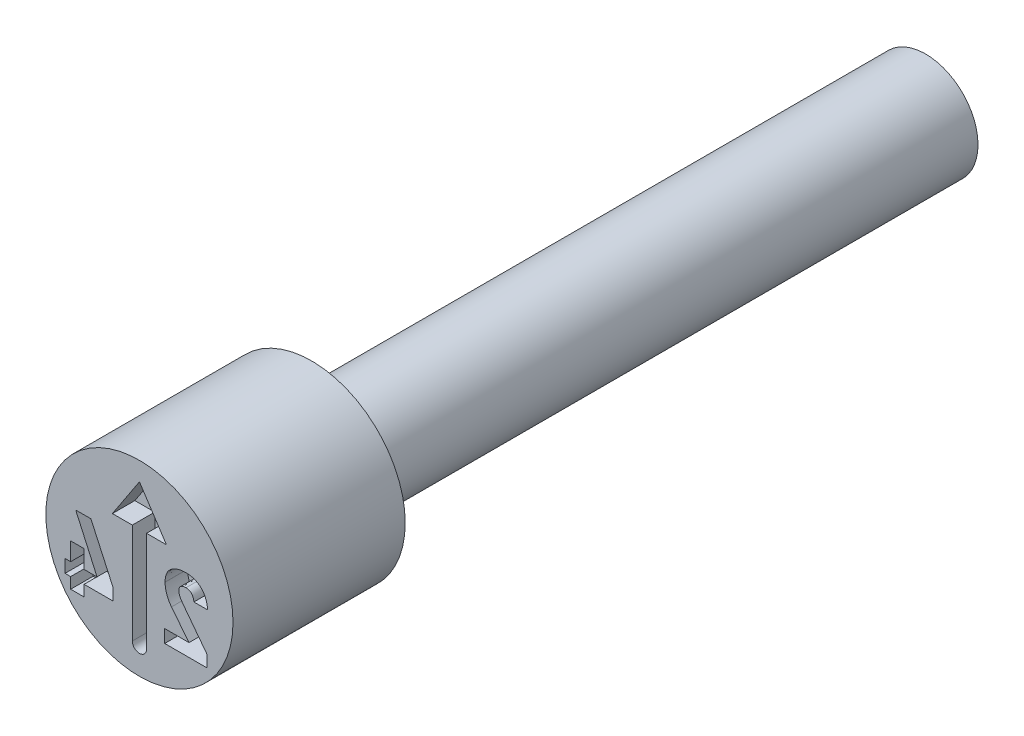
ISO-10303-21;
HEADER;
FILE_DESCRIPTION(('STEP AP214'),'2;1');
FILE_NAME('part.step','',(''),(''),'','','');
FILE_SCHEMA(('AUTOMOTIVE_DESIGN { 1 0 10303 214 1 1 1 1 }'));
ENDSEC;
DATA;
#1=APPLICATION_CONTEXT('core data for automotive mechanical design processes');
#2=APPLICATION_PROTOCOL_DEFINITION('international standard','automotive_design',2000,#1);
#3=PRODUCT_CONTEXT('',#1,'mechanical');
#4=PRODUCT('Part','Part','',(#3));
#5=PRODUCT_RELATED_PRODUCT_CATEGORY('part','',(#4));
#6=PRODUCT_DEFINITION_FORMATION('','',#4);
#7=PRODUCT_DEFINITION_CONTEXT('part definition',#1,'design');
#8=PRODUCT_DEFINITION('design','',#6,#7);
#9=PRODUCT_DEFINITION_SHAPE('','',#8);
#10=(LENGTH_UNIT() NAMED_UNIT(*) SI_UNIT(.MILLI.,.METRE.));
#11=(NAMED_UNIT(*) PLANE_ANGLE_UNIT() SI_UNIT($,.RADIAN.));
#12=(NAMED_UNIT(*) SI_UNIT($,.STERADIAN.) SOLID_ANGLE_UNIT());
#13=UNCERTAINTY_MEASURE_WITH_UNIT(LENGTH_MEASURE(1.E-05),#10,'distance_accuracy_value','');
#14=(GEOMETRIC_REPRESENTATION_CONTEXT(3) GLOBAL_UNCERTAINTY_ASSIGNED_CONTEXT((#13)) GLOBAL_UNIT_ASSIGNED_CONTEXT((#10,
#11,#12)) REPRESENTATION_CONTEXT('',''));
#15=CARTESIAN_POINT('',(0.,0.,0.));
#16=DIRECTION('',(0.,0.,1.));
#17=DIRECTION('',(1.,0.,0.));
#18=AXIS2_PLACEMENT_3D('',#15,#16,#17);
#19=CARTESIAN_POINT('',(0.,0.699999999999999,-2.3));
#20=DIRECTION('',(0.,0.,1.));
#21=DIRECTION('',(1.,0.,0.));
#22=AXIS2_PLACEMENT_3D('',#19,#20,#21);
#23=PLANE('',#22);
#24=CARTESIAN_POINT('',(0.,0.,-2.3));
#25=DIRECTION('',(0.,0.,1.));
#26=DIRECTION('',(1.,0.,0.));
#27=AXIS2_PLACEMENT_3D('',#24,#25,#26);
#28=CIRCLE('',#27,1.25);
#29=CARTESIAN_POINT('',(1.25,0.,-2.3));
#30=VERTEX_POINT('',#29);
#31=EDGE_CURVE('E11',#30,#30,#28,.T.);
#32=ORIENTED_EDGE('',*,*,#31,.F.);
#33=EDGE_LOOP('',(#32));
#34=FACE_BOUND('',#33,.T.);
#35=CARTESIAN_POINT('',(0.,0.,-2.3));
#36=DIRECTION('',(0.,0.,1.));
#37=DIRECTION('',(1.,0.,0.));
#38=AXIS2_PLACEMENT_3D('',#35,#36,#37);
#39=CIRCLE('',#38,0.699999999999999);
#40=CARTESIAN_POINT('',(0.699999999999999,0.,-2.3));
#41=VERTEX_POINT('',#40);
#42=EDGE_CURVE('E443',#41,#41,#39,.T.);
#43=ORIENTED_EDGE('',*,*,#42,.T.);
#44=EDGE_LOOP('',(#43));
#45=FACE_BOUND('',#44,.T.);
#46=ADVANCED_FACE('F34',(#34,#45),#23,.F.);
#47=CARTESIAN_POINT('',(0.,0.,-0.403888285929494));
#48=DIRECTION('',(0.,0.,1.));
#49=DIRECTION('',(1.,0.,0.));
#50=AXIS2_PLACEMENT_3D('',#47,#48,#49);
#51=CYLINDRICAL_SURFACE('',#50,1.25);
#52=CARTESIAN_POINT('',(0.,0.,0.));
#53=DIRECTION('',(0.,0.,1.));
#54=DIRECTION('',(1.,0.,0.));
#55=AXIS2_PLACEMENT_3D('',#52,#53,#54);
#56=CIRCLE('',#55,1.25);
#57=CARTESIAN_POINT('',(1.25,0.,0.));
#58=VERTEX_POINT('',#57);
#59=EDGE_CURVE('E41',#58,#58,#56,.T.);
#60=ORIENTED_EDGE('',*,*,#59,.F.);
#61=EDGE_LOOP('',(#60));
#62=FACE_BOUND('',#61,.T.);
#63=ORIENTED_EDGE('',*,*,#31,.T.);
#64=EDGE_LOOP('',(#63));
#65=FACE_BOUND('',#64,.T.);
#66=ADVANCED_FACE('F428',(#62,#65),#51,.T.);
#67=CARTESIAN_POINT('',(0.,1.25,0.));
#68=DIRECTION('',(0.,0.,-1.));
#69=DIRECTION('',(-1.,0.,0.));
#70=AXIS2_PLACEMENT_3D('',#67,#68,#69);
#71=PLANE('',#70);
#72=DIRECTION('',(-0.60539313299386,0.795926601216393,0.));
#73=VECTOR('',#72,1.);
#74=CARTESIAN_POINT('',(0.89935811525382,-0.538536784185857,0.));
#75=LINE('',#74,#73);
#76=CARTESIAN_POINT('',(0.89935811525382,-0.538536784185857,0.));
#77=VERTEX_POINT('',#76);
#78=CARTESIAN_POINT('',(0.573334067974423,-0.10990421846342,0.));
#79=VERTEX_POINT('',#78);
#80=EDGE_CURVE('E708',#77,#79,#75,.T.);
#81=ORIENTED_EDGE('',*,*,#80,.F.);
#82=DIRECTION('',(0.,1.,0.));
#83=VECTOR('',#82,1.);
#84=CARTESIAN_POINT('',(0.89935811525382,-0.7,0.));
#85=LINE('',#84,#83);
#86=CARTESIAN_POINT('',(0.89935811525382,-0.7,0.));
#87=VERTEX_POINT('',#86);
#88=EDGE_CURVE('E48',#87,#77,#85,.T.);
#89=ORIENTED_EDGE('',*,*,#88,.F.);
#90=DIRECTION('',(1.,0.,0.));
#91=VECTOR('',#90,1.);
#92=CARTESIAN_POINT('',(0.337528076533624,-0.7,0.));
#93=LINE('',#92,#91);
#94=CARTESIAN_POINT('',(0.337528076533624,-0.7,0.));
#95=VERTEX_POINT('',#94);
#96=EDGE_CURVE('E307',#95,#87,#93,.T.);
#97=ORIENTED_EDGE('',*,*,#96,.F.);
#98=DIRECTION('',(0.,-1.,0.));
#99=VECTOR('',#98,1.);
#100=CARTESIAN_POINT('',(0.337528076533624,-0.527501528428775,0.));
#101=LINE('',#100,#99);
#102=CARTESIAN_POINT('',(0.337528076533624,-0.527501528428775,0.));
#103=VERTEX_POINT('',#102);
#104=EDGE_CURVE('E310',#103,#95,#101,.T.);
#105=ORIENTED_EDGE('',*,*,#104,.F.);
#106=DIRECTION('',(-1.,0.,0.));
#107=VECTOR('',#106,1.);
#108=CARTESIAN_POINT('',(0.66219691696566,-0.527501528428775,0.));
#109=LINE('',#108,#107);
#110=CARTESIAN_POINT('',(0.66219691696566,-0.527501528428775,0.));
#111=VERTEX_POINT('',#110);
#112=EDGE_CURVE('E642',#111,#103,#109,.T.);
#113=ORIENTED_EDGE('',*,*,#112,.F.);
#114=DIRECTION('',(0.620676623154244,-0.78406666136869,0.));
#115=VECTOR('',#114,1.);
#116=CARTESIAN_POINT('',(0.428326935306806,-0.232066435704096,0.));
#117=LINE('',#116,#115);
#118=CARTESIAN_POINT('',(0.428326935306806,-0.232066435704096,0.));
#119=VERTEX_POINT('',#118);
#120=EDGE_CURVE('E645',#119,#111,#117,.T.);
#121=ORIENTED_EDGE('',*,*,#120,.F.);
#122=CARTESIAN_POINT('',(0.342755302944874,0.0114835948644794,0.));
#123=CARTESIAN_POINT('',(0.343003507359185,0.000692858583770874,0.));
#124=CARTESIAN_POINT('',(0.343500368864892,-0.0209082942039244,0.));
#125=CARTESIAN_POINT('',(0.347931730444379,-0.053179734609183,0.));
#126=CARTESIAN_POINT('',(0.355177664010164,-0.0852647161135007,0.));
#127=CARTESIAN_POINT('',(0.365009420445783,-0.11705080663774,0.));
#128=CARTESIAN_POINT('',(0.37728656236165,-0.148007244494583,0.));
#129=CARTESIAN_POINT('',(0.391938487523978,-0.177640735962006,0.));
#130=CARTESIAN_POINT('',(0.40866656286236,-0.205875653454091,0.));
#131=CARTESIAN_POINT('',(0.421774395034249,-0.223337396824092,0.));
#132=CARTESIAN_POINT('',(0.428326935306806,-0.232066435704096,0.));
#133=B_SPLINE_CURVE_WITH_KNOTS('',3,(#122,#123,#124,#125,#126,#127,#128,#129,#130,#131,#132),
.UNSPECIFIED.,.F.,.F.,(4,1,1,1,1,1,1,1,4),(0.,0.123148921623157,0.24652244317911,
0.371108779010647,0.498350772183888,0.625999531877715,0.750879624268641,0.875465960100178,1.),.UNSPECIFIED.);
#134=CARTESIAN_POINT('',(0.342755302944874,0.0114835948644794,0.));
#135=VERTEX_POINT('',#134);
#136=EDGE_CURVE('E648',#135,#119,#133,.T.);
#137=ORIENTED_EDGE('',*,*,#136,.F.);
#138=DIRECTION('',(0.,-1.,0.));
#139=VECTOR('',#138,1.);
#140=CARTESIAN_POINT('',(0.342755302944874,0.012257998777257,0.));
#141=LINE('',#140,#139);
#142=CARTESIAN_POINT('',(0.342755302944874,0.012257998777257,0.));
#143=VERTEX_POINT('',#142);
#144=EDGE_CURVE('E653',#143,#135,#141,.T.);
#145=ORIENTED_EDGE('',*,*,#144,.F.);
#146=CARTESIAN_POINT('',(0.623670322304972,0.259873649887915,0.));
#147=CARTESIAN_POINT('',(0.609390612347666,0.259575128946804,0.));
#148=CARTESIAN_POINT('',(0.581753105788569,0.258997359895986,0.));
#149=CARTESIAN_POINT('',(0.541956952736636,0.253558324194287,0.));
#150=CARTESIAN_POINT('',(0.505363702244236,0.244507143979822,0.));
#151=CARTESIAN_POINT('',(0.47206515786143,0.231790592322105,0.));
#152=CARTESIAN_POINT('',(0.442279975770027,0.215443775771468,0.));
#153=CARTESIAN_POINT('',(0.415870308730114,0.196040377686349,0.));
#154=CARTESIAN_POINT('',(0.393581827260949,0.172827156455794,0.));
#155=CARTESIAN_POINT('',(0.375042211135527,0.146456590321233,0.));
#156=CARTESIAN_POINT('',(0.360427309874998,0.117030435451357,0.));
#157=CARTESIAN_POINT('',(0.350192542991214,0.0845740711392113,0.));
#158=CARTESIAN_POINT('',(0.343924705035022,0.0493482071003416,0.));
#159=CARTESIAN_POINT('',(0.343152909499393,0.0248689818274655,0.));
#160=CARTESIAN_POINT('',(0.342755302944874,0.012257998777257,0.));
#161=B_SPLINE_CURVE_WITH_KNOTS('',3,(#146,#147,#148,#149,#150,#151,#152,#153,#154,#155,#156,
#157,#158,#159,#160),.UNSPECIFIED.,.F.,.F.,(4,1,1,1,1,1,1,1,1,1,1,1,4),(0.,0.100715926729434,
0.194929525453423,0.2827284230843,0.366191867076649,0.445669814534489,0.521804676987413,
0.596515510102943,0.671682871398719,0.748455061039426,0.827368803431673,0.911065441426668,1.),.UNSPECIFIED.);
#162=CARTESIAN_POINT('',(0.623670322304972,0.259873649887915,0.));
#163=VERTEX_POINT('',#162);
#164=EDGE_CURVE('E659',#163,#143,#161,.T.);
#165=ORIENTED_EDGE('',*,*,#164,.F.);
#166=CARTESIAN_POINT('',(0.911167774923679,-0.0243325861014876,0.));
#167=CARTESIAN_POINT('',(0.909852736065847,-0.0100305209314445,0.));
#168=CARTESIAN_POINT('',(0.90729096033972,0.0178307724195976,0.));
#169=CARTESIAN_POINT('',(0.898580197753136,0.0578975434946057,0.));
#170=CARTESIAN_POINT('',(0.885711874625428,0.094764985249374,0.));
#171=CARTESIAN_POINT('',(0.869270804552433,0.128534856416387,0.));
#172=CARTESIAN_POINT('',(0.849111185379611,0.158780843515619,0.));
#173=CARTESIAN_POINT('',(0.825720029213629,0.185494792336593,0.));
#174=CARTESIAN_POINT('',(0.798838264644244,0.208157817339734,0.));
#175=CARTESIAN_POINT('',(0.768931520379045,0.226989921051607,0.));
#176=CARTESIAN_POINT('',(0.73613042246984,0.241727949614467,0.));
#177=CARTESIAN_POINT('',(0.70083611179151,0.252466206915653,0.));
#178=CARTESIAN_POINT('',(0.662995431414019,0.258656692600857,0.));
#179=CARTESIAN_POINT('',(0.636986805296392,0.259461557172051,0.));
#180=CARTESIAN_POINT('',(0.623670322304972,0.259873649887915,0.));
#181=B_SPLINE_CURVE_WITH_KNOTS('',3,(#166,#167,#168,#169,#170,#171,#172,#173,#174,#175,#176,
#177,#178,#179,#180),.UNSPECIFIED.,.F.,.F.,(4,1,1,1,1,1,1,1,1,1,1,1,4),(0.,0.0953291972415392,
0.185707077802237,0.271513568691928,0.35413169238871,0.434493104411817,0.512233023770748,
0.58917600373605,0.667186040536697,0.746219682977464,0.827302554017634,0.911578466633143,1.),.UNSPECIFIED.);
#182=CARTESIAN_POINT('',(0.911167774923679,-0.0243325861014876,0.));
#183=VERTEX_POINT('',#182);
#184=EDGE_CURVE('E664',#183,#163,#181,.T.);
#185=ORIENTED_EDGE('',*,*,#184,.F.);
#186=DIRECTION('',(0.,1.,0.));
#187=VECTOR('',#186,1.);
#188=CARTESIAN_POINT('',(0.911167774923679,-0.0251069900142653,0.));
#189=LINE('',#188,#187);
#190=CARTESIAN_POINT('',(0.911167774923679,-0.0251069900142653,0.));
#191=VERTEX_POINT('',#190);
#192=EDGE_CURVE('E672',#191,#183,#189,.T.);
#193=ORIENTED_EDGE('',*,*,#192,.F.);
#194=DIRECTION('',(1.,0.,0.));
#195=VECTOR('',#194,1.);
#196=CARTESIAN_POINT('',(0.727634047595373,-0.0251069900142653,0.));
#197=LINE('',#196,#195);
#198=CARTESIAN_POINT('',(0.727634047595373,-0.0251069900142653,0.));
#199=VERTEX_POINT('',#198);
#200=EDGE_CURVE('E678',#199,#191,#197,.T.);
#201=ORIENTED_EDGE('',*,*,#200,.F.);
#202=DIRECTION('',(0.,-1.,0.));
#203=VECTOR('',#202,1.);
#204=CARTESIAN_POINT('',(0.727634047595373,-0.0243325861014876,0.));
#205=LINE('',#204,#203);
#206=CARTESIAN_POINT('',(0.727634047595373,-0.0243325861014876,0.));
#207=VERTEX_POINT('',#206);
#208=EDGE_CURVE('E681',#207,#199,#205,.T.);
#209=ORIENTED_EDGE('',*,*,#208,.F.);
#210=CARTESIAN_POINT('',(0.622315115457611,0.0873751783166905,0.));
#211=CARTESIAN_POINT('',(0.629385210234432,0.0870765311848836,0.));
#212=CARTESIAN_POINT('',(0.643106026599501,0.0864969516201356,0.));
#213=CARTESIAN_POINT('',(0.662623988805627,0.0809741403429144,0.));
#214=CARTESIAN_POINT('',(0.679962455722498,0.0715979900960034,0.));
#215=CARTESIAN_POINT('',(0.694971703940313,0.058639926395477,0.));
#216=CARTESIAN_POINT('',(0.70756582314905,0.0423386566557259,0.));
#217=CARTESIAN_POINT('',(0.716848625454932,0.0227009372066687,0.));
#218=CARTESIAN_POINT('',(0.724324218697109,0.000381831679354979,0.));
#219=CARTESIAN_POINT('',(0.726493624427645,-0.0158170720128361,0.));
#220=CARTESIAN_POINT('',(0.727634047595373,-0.0243325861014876,0.));
#221=B_SPLINE_CURVE_WITH_KNOTS('',3,(#210,#211,#212,#213,#214,#215,#216,#217,#218,#219,#220),
.UNSPECIFIED.,.F.,.F.,(4,1,1,1,1,1,1,1,4),(0.,0.124212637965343,0.241057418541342,
0.353359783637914,0.468536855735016,0.587568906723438,0.713021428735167,0.849139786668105,1.),.UNSPECIFIED.);
#222=CARTESIAN_POINT('',(0.622315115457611,0.0873751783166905,0.));
#223=VERTEX_POINT('',#222);
#224=EDGE_CURVE('E684',#223,#207,#221,.T.);
#225=ORIENTED_EDGE('',*,*,#224,.F.);
#226=CARTESIAN_POINT('',(0.527063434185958,0.00703077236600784,0.));
#227=CARTESIAN_POINT('',(0.527323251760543,0.0131309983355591,0.));
#228=CARTESIAN_POINT('',(0.527818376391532,0.0247559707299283,0.));
#229=CARTESIAN_POINT('',(0.532598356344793,0.0411111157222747,0.));
#230=CARTESIAN_POINT('',(0.540502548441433,0.055253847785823,0.));
#231=CARTESIAN_POINT('',(0.551574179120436,0.0671094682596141,0.));
#232=CARTESIAN_POINT('',(0.565657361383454,0.0762210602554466,0.));
#233=CARTESIAN_POINT('',(0.582269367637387,0.082877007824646,0.));
#234=CARTESIAN_POINT('',(0.601498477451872,0.0866430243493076,0.));
#235=CARTESIAN_POINT('',(0.615135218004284,0.0871226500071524,0.));
#236=CARTESIAN_POINT('',(0.622315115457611,0.0873751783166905,0.));
#237=B_SPLINE_CURVE_WITH_KNOTS('',3,(#226,#227,#228,#229,#230,#231,#232,#233,#234,#235,#236),
.UNSPECIFIED.,.F.,.F.,(4,1,1,1,1,1,1,1,4),(0.,0.129170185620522,0.246154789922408,
0.35773418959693,0.470108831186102,0.586692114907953,0.710769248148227,0.847716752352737,1.),.UNSPECIFIED.);
#238=CARTESIAN_POINT('',(0.527063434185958,0.00703077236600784,0.));
#239=VERTEX_POINT('',#238);
#240=EDGE_CURVE('E689',#239,#223,#237,.T.);
#241=ORIENTED_EDGE('',*,*,#240,.F.);
#242=DIRECTION('',(0.,1.,0.));
#243=VECTOR('',#242,1.);
#244=CARTESIAN_POINT('',(0.527063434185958,0.0056755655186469,0.));
#245=LINE('',#244,#243);
#246=CARTESIAN_POINT('',(0.527063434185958,0.0056755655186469,0.));
#247=VERTEX_POINT('',#246);
#248=EDGE_CURVE('E697',#247,#239,#245,.T.);
#249=ORIENTED_EDGE('',*,*,#248,.F.);
#250=CARTESIAN_POINT('',(0.573334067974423,-0.10990421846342,0.));
#251=CARTESIAN_POINT('',(0.566496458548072,-0.100417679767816,0.));
#252=CARTESIAN_POINT('',(0.553148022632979,-0.0818979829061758,0.));
#253=CARTESIAN_POINT('',(0.541205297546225,-0.0563541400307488,0.));
#254=CARTESIAN_POINT('',(0.53361847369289,-0.0363251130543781,0.));
#255=CARTESIAN_POINT('',(0.530110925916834,-0.0217963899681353,0.));
#256=CARTESIAN_POINT('',(0.527514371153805,-0.00790365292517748,0.));
#257=CARTESIAN_POINT('',(0.527211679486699,0.00121140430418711,0.));
#258=CARTESIAN_POINT('',(0.527063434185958,0.0056755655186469,0.));
#259=B_SPLINE_CURVE_WITH_KNOTS('',3,(#250,#251,#252,#253,#254,#255,#256,#257,#258),
.UNSPECIFIED.,.F.,.F.,(4,1,1,1,1,1,4),(0.,0.27673722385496,0.540248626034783,0.66563356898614,
0.784034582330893,0.894229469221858,1.),.UNSPECIFIED.);
#260=EDGE_CURVE('E703',#79,#247,#259,.T.);
#261=ORIENTED_EDGE('',*,*,#260,.F.);
#262=EDGE_LOOP('',(#81,#89,#97,#105,#113,#121,#137,#145,#165,#185,#193,#201,#209,#225,#241,#249,#261));
#263=FACE_BOUND('',#262,.T.);
#264=DIRECTION('',(0.,-1.,0.));
#265=VECTOR('',#264,1.);
#266=CARTESIAN_POINT('',(-0.91819884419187,-0.141267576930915,0.));
#267=LINE('',#266,#265);
#268=CARTESIAN_POINT('',(-0.91819884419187,-0.141267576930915,0.));
#269=VERTEX_POINT('',#268);
#270=CARTESIAN_POINT('',(-0.91819884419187,-0.38171999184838,0.));
#271=VERTEX_POINT('',#270);
#272=EDGE_CURVE('E591',#269,#271,#267,.T.);
#273=ORIENTED_EDGE('',*,*,#272,.F.);
#274=DIRECTION('',(-1.,0.,0.));
#275=VECTOR('',#274,1.);
#276=CARTESIAN_POINT('',(-0.739117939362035,-0.141267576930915,0.));
#277=LINE('',#276,#275);
#278=CARTESIAN_POINT('',(-0.739117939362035,-0.141267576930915,0.));
#279=VERTEX_POINT('',#278);
#280=EDGE_CURVE('E594',#279,#269,#277,.T.);
#281=ORIENTED_EDGE('',*,*,#280,.F.);
#282=DIRECTION('',(0.,1.,0.));
#283=VECTOR('',#282,1.);
#284=CARTESIAN_POINT('',(-0.739117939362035,-0.700580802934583,0.));
#285=LINE('',#284,#283);
#286=CARTESIAN_POINT('',(-0.739117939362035,-0.38171999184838,0.));
#287=VERTEX_POINT('',#286);
#288=EDGE_CURVE('E599',#287,#279,#285,.T.);
#289=ORIENTED_EDGE('',*,*,#288,.F.);
#290=DIRECTION('',(-1.,0.,0.));
#291=VECTOR('',#290,1.);
#292=CARTESIAN_POINT('',(-0.566038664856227,-0.38171999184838,0.));
#293=LINE('',#292,#291);
#294=CARTESIAN_POINT('',(-0.566038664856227,-0.38171999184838,0.));
#295=VERTEX_POINT('',#294);
#296=EDGE_CURVE('E532',#295,#287,#293,.T.);
#297=ORIENTED_EDGE('',*,*,#296,.F.);
#298=DIRECTION('',(0.411526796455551,-0.911397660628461,0.));
#299=VECTOR('',#298,1.);
#300=CARTESIAN_POINT('',(-0.851019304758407,0.249419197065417,0.));
#301=LINE('',#300,#299);
#302=CARTESIAN_POINT('',(-0.851019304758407,0.249419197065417,0.));
#303=VERTEX_POINT('',#302);
#304=EDGE_CURVE('E536',#303,#295,#301,.T.);
#305=ORIENTED_EDGE('',*,*,#304,.F.);
#306=DIRECTION('',(-1.,0.,0.));
#307=VECTOR('',#306,1.);
#308=CARTESIAN_POINT('',(-0.648319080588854,0.249419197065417,0.));
#309=LINE('',#308,#307);
#310=CARTESIAN_POINT('',(-0.648319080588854,0.249419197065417,0.));
#311=VERTEX_POINT('',#310);
#312=EDGE_CURVE('E539',#311,#303,#309,.T.);
#313=ORIENTED_EDGE('',*,*,#312,.F.);
#314=DIRECTION('',(-0.416436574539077,0.909164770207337,0.));
#315=VECTOR('',#314,1.);
#316=CARTESIAN_POINT('',(-0.355594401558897,-0.389657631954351,0.));
#317=LINE('',#316,#315);
#318=CARTESIAN_POINT('',(-0.355594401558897,-0.389657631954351,0.));
#319=VERTEX_POINT('',#318);
#320=EDGE_CURVE('E542',#319,#311,#317,.T.);
#321=ORIENTED_EDGE('',*,*,#320,.F.);
#322=DIRECTION('',(0.,1.,0.));
#323=VECTOR('',#322,1.);
#324=CARTESIAN_POINT('',(-0.355594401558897,-0.554218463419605,0.));
#325=LINE('',#324,#323);
#326=CARTESIAN_POINT('',(-0.355594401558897,-0.554218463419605,0.));
#327=VERTEX_POINT('',#326);
#328=EDGE_CURVE('E545',#327,#319,#325,.T.);
#329=ORIENTED_EDGE('',*,*,#328,.F.);
#330=DIRECTION('',(1.,0.,0.));
#331=VECTOR('',#330,1.);
#332=CARTESIAN_POINT('',(-0.99273522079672,-0.554218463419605,0.));
#333=LINE('',#332,#331);
#334=CARTESIAN_POINT('',(-0.739117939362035,-0.554218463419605,0.));
#335=VERTEX_POINT('',#334);
#336=EDGE_CURVE('E528',#335,#327,#333,.T.);
#337=ORIENTED_EDGE('',*,*,#336,.F.);
#338=CARTESIAN_POINT('',(-0.739117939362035,-0.700580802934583,0.));
#339=VERTEX_POINT('',#338);
#340=EDGE_CURVE('E597',#339,#335,#285,.T.);
#341=ORIENTED_EDGE('',*,*,#340,.F.);
#342=DIRECTION('',(1.,0.,0.));
#343=VECTOR('',#342,1.);
#344=CARTESIAN_POINT('',(-0.91819884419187,-0.700580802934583,0.));
#345=LINE('',#344,#343);
#346=CARTESIAN_POINT('',(-0.91819884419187,-0.700580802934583,0.));
#347=VERTEX_POINT('',#346);
#348=EDGE_CURVE('E588',#347,#339,#345,.T.);
#349=ORIENTED_EDGE('',*,*,#348,.F.);
#350=CARTESIAN_POINT('',(-0.91819884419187,-0.554218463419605,0.));
#351=VERTEX_POINT('',#350);
#352=EDGE_CURVE('E593',#351,#347,#267,.T.);
#353=ORIENTED_EDGE('',*,*,#352,.F.);
#354=CARTESIAN_POINT('',(-0.99273522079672,-0.554218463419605,0.));
#355=VERTEX_POINT('',#354);
#356=EDGE_CURVE('E524',#355,#351,#333,.T.);
#357=ORIENTED_EDGE('',*,*,#356,.F.);
#358=DIRECTION('',(0.,-1.,0.));
#359=VECTOR('',#358,1.);
#360=CARTESIAN_POINT('',(-0.99273522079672,-0.38171999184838,0.));
#361=LINE('',#360,#359);
#362=CARTESIAN_POINT('',(-0.99273522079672,-0.38171999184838,0.));
#363=VERTEX_POINT('',#362);
#364=EDGE_CURVE('E529',#363,#355,#361,.T.);
#365=ORIENTED_EDGE('',*,*,#364,.F.);
#366=EDGE_CURVE('E535',#271,#363,#293,.T.);
#367=ORIENTED_EDGE('',*,*,#366,.F.);
#368=EDGE_LOOP('',(#273,#281,#289,#297,#305,#313,#321,#329,#337,#341,#349,#353,#357,#365,#367));
#369=FACE_BOUND('',#368,.T.);
#370=DIRECTION('',(0.,1.,0.));
#371=VECTOR('',#370,1.);
#372=CARTESIAN_POINT('',(0.0952365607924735,0.453175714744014,0.));
#373=LINE('',#372,#371);
#374=CARTESIAN_POINT('',(0.0952365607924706,-0.888080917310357,0.));
#375=VERTEX_POINT('',#374);
#376=CARTESIAN_POINT('',(0.0952365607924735,0.453175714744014,0.));
#377=VERTEX_POINT('',#376);
#378=EDGE_CURVE('E482',#375,#377,#373,.T.);
#379=ORIENTED_EDGE('',*,*,#378,.F.);
#380=CARTESIAN_POINT('',(0.,-0.888080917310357,0.));
#381=DIRECTION('',(0.,0.,1.));
#382=DIRECTION('',(1.,0.,0.));
#383=AXIS2_PLACEMENT_3D('',#380,#381,#382);
#384=CIRCLE('',#383,0.0952365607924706);
#385=CARTESIAN_POINT('',(-0.0952365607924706,-0.888080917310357,0.));
#386=VERTEX_POINT('',#385);
#387=EDGE_CURVE('E485',#386,#375,#384,.T.);
#388=ORIENTED_EDGE('',*,*,#387,.F.);
#389=DIRECTION('',(0.,-1.,0.));
#390=VECTOR('',#389,1.);
#391=CARTESIAN_POINT('',(-0.0952365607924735,0.453175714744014,0.));
#392=LINE('',#391,#390);
#393=CARTESIAN_POINT('',(-0.0952365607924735,0.453175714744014,0.));
#394=VERTEX_POINT('',#393);
#395=EDGE_CURVE('E466',#394,#386,#392,.T.);
#396=ORIENTED_EDGE('',*,*,#395,.F.);
#397=DIRECTION('',(1.,0.,0.));
#398=VECTOR('',#397,1.);
#399=CARTESIAN_POINT('',(-0.360958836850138,0.453175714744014,0.));
#400=LINE('',#399,#398);
#401=CARTESIAN_POINT('',(-0.360958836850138,0.453175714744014,0.));
#402=VERTEX_POINT('',#401);
#403=EDGE_CURVE('E470',#402,#394,#400,.T.);
#404=ORIENTED_EDGE('',*,*,#403,.F.);
#405=DIRECTION('',(-0.550159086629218,-0.835059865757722,0.));
#406=VECTOR('',#405,1.);
#407=CARTESIAN_POINT('',(0.,1.00105767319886,0.));
#408=LINE('',#407,#406);
#409=CARTESIAN_POINT('',(0.,1.00105767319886,0.));
#410=VERTEX_POINT('',#409);
#411=EDGE_CURVE('E473',#410,#402,#408,.T.);
#412=ORIENTED_EDGE('',*,*,#411,.F.);
#413=DIRECTION('',(-0.550159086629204,0.835059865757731,0.));
#414=VECTOR('',#413,1.);
#415=CARTESIAN_POINT('',(0.,1.00105767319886,0.));
#416=LINE('',#415,#414);
#417=CARTESIAN_POINT('',(0.360958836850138,0.453175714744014,0.));
#418=VERTEX_POINT('',#417);
#419=EDGE_CURVE('E476',#418,#410,#416,.T.);
#420=ORIENTED_EDGE('',*,*,#419,.F.);
#421=DIRECTION('',(1.,0.,0.));
#422=VECTOR('',#421,1.);
#423=CARTESIAN_POINT('',(0.360958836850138,0.453175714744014,0.));
#424=LINE('',#423,#422);
#425=EDGE_CURVE('E479',#377,#418,#424,.T.);
#426=ORIENTED_EDGE('',*,*,#425,.F.);
#427=EDGE_LOOP('',(#379,#388,#396,#404,#412,#420,#426));
#428=FACE_BOUND('',#427,.T.);
#429=ORIENTED_EDGE('',*,*,#59,.T.);
#430=EDGE_LOOP('',(#429));
#431=FACE_BOUND('',#430,.T.);
#432=ADVANCED_FACE('F425',(#263,#369,#428,#431),#71,.F.);
#433=CARTESIAN_POINT('',(0.,0.,-10.5));
#434=DIRECTION('',(0.,0.,1.));
#435=DIRECTION('',(1.,0.,0.));
#436=AXIS2_PLACEMENT_3D('',#433,#434,#435);
#437=PLANE('',#436);
#438=CARTESIAN_POINT('',(0.,0.,-10.5));
#439=DIRECTION('',(0.,0.,1.));
#440=DIRECTION('',(1.,0.,0.));
#441=AXIS2_PLACEMENT_3D('',#438,#439,#440);
#442=CIRCLE('',#441,0.7);
#443=CARTESIAN_POINT('',(0.7,0.,-10.5));
#444=VERTEX_POINT('',#443);
#445=EDGE_CURVE('E444',#444,#444,#442,.T.);
#446=ORIENTED_EDGE('',*,*,#445,.F.);
#447=EDGE_LOOP('',(#446));
#448=FACE_BOUND('',#447,.T.);
#449=ADVANCED_FACE('F421',(#448),#437,.F.);
#450=CARTESIAN_POINT('',(0.,0.,-0.403888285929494));
#451=DIRECTION('',(0.,0.,1.));
#452=DIRECTION('',(1.,0.,0.));
#453=AXIS2_PLACEMENT_3D('',#450,#451,#452);
#454=CYLINDRICAL_SURFACE('',#453,0.699999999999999);
#455=ORIENTED_EDGE('',*,*,#42,.F.);
#456=EDGE_LOOP('',(#455));
#457=FACE_BOUND('',#456,.T.);
#458=ORIENTED_EDGE('',*,*,#445,.T.);
#459=EDGE_LOOP('',(#458));
#460=FACE_BOUND('',#459,.T.);
#461=ADVANCED_FACE('F417',(#457,#460),#454,.T.);
#462=CARTESIAN_POINT('',(0.,-0.888080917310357,-0.3));
#463=DIRECTION('',(0.,0.,1.));
#464=DIRECTION('',(1.,0.,0.));
#465=AXIS2_PLACEMENT_3D('',#462,#463,#464);
#466=CYLINDRICAL_SURFACE('',#465,0.0952365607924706);
#467=ORIENTED_EDGE('',*,*,#387,.T.);
#468=DIRECTION('',(0.,0.,1.));
#469=VECTOR('',#468,1.);
#470=CARTESIAN_POINT('',(0.0952365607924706,-0.888080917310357,-0.3));
#471=LINE('',#470,#469);
#472=CARTESIAN_POINT('',(0.0952365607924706,-0.888080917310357,-0.3));
#473=VERTEX_POINT('',#472);
#474=EDGE_CURVE('E452',#473,#375,#471,.T.);
#475=ORIENTED_EDGE('',*,*,#474,.F.);
#476=CARTESIAN_POINT('',(0.,-0.888080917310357,-0.3));
#477=DIRECTION('',(0.,0.,1.));
#478=DIRECTION('',(1.,0.,0.));
#479=AXIS2_PLACEMENT_3D('',#476,#477,#478);
#480=CIRCLE('',#479,0.0952365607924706);
#481=CARTESIAN_POINT('',(-0.0952365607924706,-0.888080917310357,-0.3));
#482=VERTEX_POINT('',#481);
#483=EDGE_CURVE('E469',#482,#473,#480,.T.);
#484=ORIENTED_EDGE('',*,*,#483,.F.);
#485=DIRECTION('',(0.,0.,1.));
#486=VECTOR('',#485,1.);
#487=CARTESIAN_POINT('',(-0.0952365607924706,-0.888080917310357,-0.3));
#488=LINE('',#487,#486);
#489=EDGE_CURVE('E445',#482,#386,#488,.T.);
#490=ORIENTED_EDGE('',*,*,#489,.T.);
#491=EDGE_LOOP('',(#467,#475,#484,#490));
#492=FACE_BOUND('',#491,.T.);
#493=ADVANCED_FACE('F395',(#492),#466,.F.);
#494=CARTESIAN_POINT('',(-0.0952365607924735,0.453175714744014,-0.3));
#495=DIRECTION('',(-1.,0.,0.));
#496=DIRECTION('',(0.,-1.,0.));
#497=AXIS2_PLACEMENT_3D('',#494,#495,#496);
#498=PLANE('',#497);
#499=ORIENTED_EDGE('',*,*,#395,.T.);
#500=ORIENTED_EDGE('',*,*,#489,.F.);
#501=DIRECTION('',(0.,-1.,0.));
#502=VECTOR('',#501,1.);
#503=CARTESIAN_POINT('',(-0.0952365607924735,0.453175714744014,-0.3));
#504=LINE('',#503,#502);
#505=CARTESIAN_POINT('',(-0.0952365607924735,0.453175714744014,-0.3));
#506=VERTEX_POINT('',#505);
#507=EDGE_CURVE('E457',#506,#482,#504,.T.);
#508=ORIENTED_EDGE('',*,*,#507,.F.);
#509=DIRECTION('',(0.,0.,1.));
#510=VECTOR('',#509,1.);
#511=CARTESIAN_POINT('',(-0.0952365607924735,0.453175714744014,-0.3));
#512=LINE('',#511,#510);
#513=EDGE_CURVE('E449',#506,#394,#512,.T.);
#514=ORIENTED_EDGE('',*,*,#513,.T.);
#515=EDGE_LOOP('',(#499,#500,#508,#514));
#516=FACE_BOUND('',#515,.T.);
#517=ADVANCED_FACE('F391',(#516),#498,.F.);
#518=CARTESIAN_POINT('',(-0.360958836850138,0.453175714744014,-0.3));
#519=DIRECTION('',(0.,-1.,0.));
#520=DIRECTION('',(0.,0.,-1.));
#521=AXIS2_PLACEMENT_3D('',#518,#519,#520);
#522=PLANE('',#521);
#523=ORIENTED_EDGE('',*,*,#403,.T.);
#524=ORIENTED_EDGE('',*,*,#513,.F.);
#525=DIRECTION('',(1.,0.,0.));
#526=VECTOR('',#525,1.);
#527=CARTESIAN_POINT('',(-0.360958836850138,0.453175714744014,-0.3));
#528=LINE('',#527,#526);
#529=CARTESIAN_POINT('',(-0.360958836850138,0.453175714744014,-0.3));
#530=VERTEX_POINT('',#529);
#531=EDGE_CURVE('E490',#530,#506,#528,.T.);
#532=ORIENTED_EDGE('',*,*,#531,.F.);
#533=DIRECTION('',(0.,0.,1.));
#534=VECTOR('',#533,1.);
#535=CARTESIAN_POINT('',(-0.360958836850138,0.453175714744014,-0.3));
#536=LINE('',#535,#534);
#537=EDGE_CURVE('E463',#530,#402,#536,.T.);
#538=ORIENTED_EDGE('',*,*,#537,.T.);
#539=EDGE_LOOP('',(#523,#524,#532,#538));
#540=FACE_BOUND('',#539,.T.);
#541=ADVANCED_FACE('F394',(#540),#522,.F.);
#542=CARTESIAN_POINT('',(0.,1.00105767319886,-0.3));
#543=DIRECTION('',(-0.835059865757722,0.550159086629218,0.));
#544=DIRECTION('',(-0.550159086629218,-0.835059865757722,0.));
#545=AXIS2_PLACEMENT_3D('',#542,#543,#544);
#546=PLANE('',#545);
#547=ORIENTED_EDGE('',*,*,#411,.T.);
#548=ORIENTED_EDGE('',*,*,#537,.F.);
#549=DIRECTION('',(-0.550159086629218,-0.835059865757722,0.));
#550=VECTOR('',#549,1.);
#551=CARTESIAN_POINT('',(0.,1.00105767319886,-0.3));
#552=LINE('',#551,#550);
#553=CARTESIAN_POINT('',(0.,1.00105767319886,-0.3));
#554=VERTEX_POINT('',#553);
#555=EDGE_CURVE('E493',#554,#530,#552,.T.);
#556=ORIENTED_EDGE('',*,*,#555,.F.);
#557=DIRECTION('',(0.,0.,1.));
#558=VECTOR('',#557,1.);
#559=CARTESIAN_POINT('',(0.,1.00105767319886,-0.3));
#560=LINE('',#559,#558);
#561=EDGE_CURVE('E461',#554,#410,#560,.T.);
#562=ORIENTED_EDGE('',*,*,#561,.T.);
#563=EDGE_LOOP('',(#547,#548,#556,#562));
#564=FACE_BOUND('',#563,.T.);
#565=ADVANCED_FACE('F399',(#564),#546,.F.);
#566=CARTESIAN_POINT('',(0.,1.00105767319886,-0.3));
#567=DIRECTION('',(0.835059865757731,0.550159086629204,0.));
#568=DIRECTION('',(-0.550159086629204,0.835059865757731,0.));
#569=AXIS2_PLACEMENT_3D('',#566,#567,#568);
#570=PLANE('',#569);
#571=ORIENTED_EDGE('',*,*,#419,.T.);
#572=ORIENTED_EDGE('',*,*,#561,.F.);
#573=DIRECTION('',(-0.550159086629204,0.835059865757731,0.));
#574=VECTOR('',#573,1.);
#575=CARTESIAN_POINT('',(0.,1.00105767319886,-0.3));
#576=LINE('',#575,#574);
#577=CARTESIAN_POINT('',(0.360958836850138,0.453175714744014,-0.3));
#578=VERTEX_POINT('',#577);
#579=EDGE_CURVE('E496',#578,#554,#576,.T.);
#580=ORIENTED_EDGE('',*,*,#579,.F.);
#581=DIRECTION('',(0.,0.,1.));
#582=VECTOR('',#581,1.);
#583=CARTESIAN_POINT('',(0.360958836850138,0.453175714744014,-0.3));
#584=LINE('',#583,#582);
#585=EDGE_CURVE('E459',#578,#418,#584,.T.);
#586=ORIENTED_EDGE('',*,*,#585,.T.);
#587=EDGE_LOOP('',(#571,#572,#580,#586));
#588=FACE_BOUND('',#587,.T.);
#589=ADVANCED_FACE('F403',(#588),#570,.F.);
#590=CARTESIAN_POINT('',(0.360958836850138,0.453175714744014,-0.3));
#591=DIRECTION('',(0.,-1.,0.));
#592=DIRECTION('',(0.,0.,-1.));
#593=AXIS2_PLACEMENT_3D('',#590,#591,#592);
#594=PLANE('',#593);
#595=ORIENTED_EDGE('',*,*,#425,.T.);
#596=ORIENTED_EDGE('',*,*,#585,.F.);
#597=DIRECTION('',(1.,0.,0.));
#598=VECTOR('',#597,1.);
#599=CARTESIAN_POINT('',(0.360958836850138,0.453175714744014,-0.3));
#600=LINE('',#599,#598);
#601=CARTESIAN_POINT('',(0.0952365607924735,0.453175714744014,-0.3));
#602=VERTEX_POINT('',#601);
#603=EDGE_CURVE('E499',#602,#578,#600,.T.);
#604=ORIENTED_EDGE('',*,*,#603,.F.);
#605=DIRECTION('',(0.,0.,1.));
#606=VECTOR('',#605,1.);
#607=CARTESIAN_POINT('',(0.0952365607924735,0.453175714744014,-0.3));
#608=LINE('',#607,#606);
#609=EDGE_CURVE('E456',#602,#377,#608,.T.);
#610=ORIENTED_EDGE('',*,*,#609,.T.);
#611=EDGE_LOOP('',(#595,#596,#604,#610));
#612=FACE_BOUND('',#611,.T.);
#613=ADVANCED_FACE('F407',(#612),#594,.F.);
#614=CARTESIAN_POINT('',(0.0952365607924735,0.453175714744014,-0.3));
#615=DIRECTION('',(1.,0.,0.));
#616=DIRECTION('',(0.,1.,0.));
#617=AXIS2_PLACEMENT_3D('',#614,#615,#616);
#618=PLANE('',#617);
#619=ORIENTED_EDGE('',*,*,#378,.T.);
#620=ORIENTED_EDGE('',*,*,#609,.F.);
#621=DIRECTION('',(0.,1.,0.));
#622=VECTOR('',#621,1.);
#623=CARTESIAN_POINT('',(0.0952365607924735,0.453175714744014,-0.3));
#624=LINE('',#623,#622);
#625=EDGE_CURVE('E502',#473,#602,#624,.T.);
#626=ORIENTED_EDGE('',*,*,#625,.F.);
#627=ORIENTED_EDGE('',*,*,#474,.T.);
#628=EDGE_LOOP('',(#619,#620,#626,#627));
#629=FACE_BOUND('',#628,.T.);
#630=ADVANCED_FACE('F389',(#629),#618,.F.);
#631=CARTESIAN_POINT('',(0.,-0.888080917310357,-0.3));
#632=DIRECTION('',(0.,0.,1.));
#633=DIRECTION('',(1.,0.,0.));
#634=AXIS2_PLACEMENT_3D('',#631,#632,#633);
#635=PLANE('',#634);
#636=ORIENTED_EDGE('',*,*,#483,.T.);
#637=ORIENTED_EDGE('',*,*,#625,.T.);
#638=ORIENTED_EDGE('',*,*,#603,.T.);
#639=ORIENTED_EDGE('',*,*,#579,.T.);
#640=ORIENTED_EDGE('',*,*,#555,.T.);
#641=ORIENTED_EDGE('',*,*,#531,.T.);
#642=ORIENTED_EDGE('',*,*,#507,.T.);
#643=EDGE_LOOP('',(#636,#637,#638,#639,#640,#641,#642));
#644=FACE_BOUND('',#643,.T.);
#645=ADVANCED_FACE('F386',(#644),#635,.T.);
#646=CARTESIAN_POINT('',(-0.99273522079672,-0.554218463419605,-0.3));
#647=DIRECTION('',(0.,-1.,0.));
#648=DIRECTION('',(0.,0.,-1.));
#649=AXIS2_PLACEMENT_3D('',#646,#647,#648);
#650=PLANE('',#649);
#651=DIRECTION('',(0.,0.,1.));
#652=VECTOR('',#651,1.);
#653=CARTESIAN_POINT('',(-0.739117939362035,-0.554218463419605,-0.3));
#654=LINE('',#653,#652);
#655=CARTESIAN_POINT('',(-0.739117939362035,-0.554218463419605,-0.3));
#656=VERTEX_POINT('',#655);
#657=EDGE_CURVE('E548',#656,#335,#654,.T.);
#658=ORIENTED_EDGE('',*,*,#657,.T.);
#659=ORIENTED_EDGE('',*,*,#336,.T.);
#660=DIRECTION('',(0.,0.,1.));
#661=VECTOR('',#660,1.);
#662=CARTESIAN_POINT('',(-0.355594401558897,-0.554218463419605,-0.3));
#663=LINE('',#662,#661);
#664=CARTESIAN_POINT('',(-0.355594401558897,-0.554218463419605,-0.3));
#665=VERTEX_POINT('',#664);
#666=EDGE_CURVE('E521',#665,#327,#663,.T.);
#667=ORIENTED_EDGE('',*,*,#666,.F.);
#668=DIRECTION('',(1.,0.,0.));
#669=VECTOR('',#668,1.);
#670=CARTESIAN_POINT('',(-0.99273522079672,-0.554218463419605,-0.3));
#671=LINE('',#670,#669);
#672=EDGE_CURVE('E551',#656,#665,#671,.T.);
#673=ORIENTED_EDGE('',*,*,#672,.F.);
#674=EDGE_LOOP('',(#658,#659,#667,#673));
#675=FACE_BOUND('',#674,.T.);
#676=ADVANCED_FACE('F363',(#675),#650,.F.);
#677=CARTESIAN_POINT('',(-0.566038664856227,-0.38171999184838,-0.3));
#678=DIRECTION('',(0.,1.,0.));
#679=DIRECTION('',(0.,0.,1.));
#680=AXIS2_PLACEMENT_3D('',#677,#678,#679);
#681=PLANE('',#680);
#682=DIRECTION('',(0.,0.,-1.));
#683=VECTOR('',#682,1.);
#684=CARTESIAN_POINT('',(-0.739117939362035,-0.38171999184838,-0.3));
#685=LINE('',#684,#683);
#686=CARTESIAN_POINT('',(-0.739117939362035,-0.38171999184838,-0.3));
#687=VERTEX_POINT('',#686);
#688=EDGE_CURVE('E572',#287,#687,#685,.T.);
#689=ORIENTED_EDGE('',*,*,#688,.T.);
#690=DIRECTION('',(-1.,0.,0.));
#691=VECTOR('',#690,1.);
#692=CARTESIAN_POINT('',(-0.566038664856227,-0.38171999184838,-0.3));
#693=LINE('',#692,#691);
#694=CARTESIAN_POINT('',(-0.566038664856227,-0.38171999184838,-0.3));
#695=VERTEX_POINT('',#694);
#696=EDGE_CURVE('E555',#695,#687,#693,.T.);
#697=ORIENTED_EDGE('',*,*,#696,.F.);
#698=DIRECTION('',(0.,0.,1.));
#699=VECTOR('',#698,1.);
#700=CARTESIAN_POINT('',(-0.566038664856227,-0.38171999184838,-0.3));
#701=LINE('',#700,#699);
#702=EDGE_CURVE('E514',#695,#295,#701,.T.);
#703=ORIENTED_EDGE('',*,*,#702,.T.);
#704=ORIENTED_EDGE('',*,*,#296,.T.);
#705=EDGE_LOOP('',(#689,#697,#703,#704));
#706=FACE_BOUND('',#705,.T.);
#707=ADVANCED_FACE('F372',(#706),#681,.F.);
#708=CARTESIAN_POINT('',(-0.355594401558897,-0.554218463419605,-0.3));
#709=DIRECTION('',(1.,0.,0.));
#710=DIRECTION('',(0.,0.,-1.));
#711=AXIS2_PLACEMENT_3D('',#708,#709,#710);
#712=PLANE('',#711);
#713=ORIENTED_EDGE('',*,*,#328,.T.);
#714=DIRECTION('',(0.,0.,1.));
#715=VECTOR('',#714,1.);
#716=CARTESIAN_POINT('',(-0.355594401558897,-0.389657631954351,-0.3));
#717=LINE('',#716,#715);
#718=CARTESIAN_POINT('',(-0.355594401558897,-0.389657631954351,-0.3));
#719=VERTEX_POINT('',#718);
#720=EDGE_CURVE('E507',#719,#319,#717,.T.);
#721=ORIENTED_EDGE('',*,*,#720,.F.);
#722=DIRECTION('',(0.,1.,0.));
#723=VECTOR('',#722,1.);
#724=CARTESIAN_POINT('',(-0.355594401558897,-0.554218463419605,-0.3));
#725=LINE('',#724,#723);
#726=EDGE_CURVE('E527',#665,#719,#725,.T.);
#727=ORIENTED_EDGE('',*,*,#726,.F.);
#728=ORIENTED_EDGE('',*,*,#666,.T.);
#729=EDGE_LOOP('',(#713,#721,#727,#728));
#730=FACE_BOUND('',#729,.T.);
#731=ADVANCED_FACE('F361',(#730),#712,.F.);
#732=DIRECTION('',(0.,0.,-1.));
#733=VECTOR('',#732,1.);
#734=CARTESIAN_POINT('',(-0.91819884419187,-0.554218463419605,-0.3));
#735=LINE('',#734,#733);
#736=CARTESIAN_POINT('',(-0.91819884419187,-0.554218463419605,-0.3));
#737=VERTEX_POINT('',#736);
#738=EDGE_CURVE('E574',#351,#737,#735,.T.);
#739=ORIENTED_EDGE('',*,*,#738,.T.);
#740=CARTESIAN_POINT('',(-0.99273522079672,-0.554218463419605,-0.3));
#741=VERTEX_POINT('',#740);
#742=EDGE_CURVE('E510',#741,#737,#671,.T.);
#743=ORIENTED_EDGE('',*,*,#742,.F.);
#744=DIRECTION('',(0.,0.,1.));
#745=VECTOR('',#744,1.);
#746=CARTESIAN_POINT('',(-0.99273522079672,-0.554218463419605,-0.3));
#747=LINE('',#746,#745);
#748=EDGE_CURVE('E519',#741,#355,#747,.T.);
#749=ORIENTED_EDGE('',*,*,#748,.T.);
#750=ORIENTED_EDGE('',*,*,#356,.T.);
#751=EDGE_LOOP('',(#739,#743,#749,#750));
#752=FACE_BOUND('',#751,.T.);
#753=ADVANCED_FACE('F357',(#752),#650,.F.);
#754=CARTESIAN_POINT('',(-0.99273522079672,-0.38171999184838,-0.3));
#755=DIRECTION('',(-1.,0.,0.));
#756=DIRECTION('',(0.,0.,1.));
#757=AXIS2_PLACEMENT_3D('',#754,#755,#756);
#758=PLANE('',#757);
#759=ORIENTED_EDGE('',*,*,#364,.T.);
#760=ORIENTED_EDGE('',*,*,#748,.F.);
#761=DIRECTION('',(0.,-1.,0.));
#762=VECTOR('',#761,1.);
#763=CARTESIAN_POINT('',(-0.99273522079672,-0.38171999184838,-0.3));
#764=LINE('',#763,#762);
#765=CARTESIAN_POINT('',(-0.99273522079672,-0.38171999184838,-0.3));
#766=VERTEX_POINT('',#765);
#767=EDGE_CURVE('E552',#766,#741,#764,.T.);
#768=ORIENTED_EDGE('',*,*,#767,.F.);
#769=DIRECTION('',(0.,0.,1.));
#770=VECTOR('',#769,1.);
#771=CARTESIAN_POINT('',(-0.99273522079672,-0.38171999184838,-0.3));
#772=LINE('',#771,#770);
#773=EDGE_CURVE('E516',#766,#363,#772,.T.);
#774=ORIENTED_EDGE('',*,*,#773,.T.);
#775=EDGE_LOOP('',(#759,#760,#768,#774));
#776=FACE_BOUND('',#775,.T.);
#777=ADVANCED_FACE('F360',(#776),#758,.F.);
#778=DIRECTION('',(0.,0.,1.));
#779=VECTOR('',#778,1.);
#780=CARTESIAN_POINT('',(-0.91819884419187,-0.38171999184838,-0.3));
#781=LINE('',#780,#779);
#782=CARTESIAN_POINT('',(-0.91819884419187,-0.38171999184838,-0.3));
#783=VERTEX_POINT('',#782);
#784=EDGE_CURVE('E576',#783,#271,#781,.T.);
#785=ORIENTED_EDGE('',*,*,#784,.T.);
#786=ORIENTED_EDGE('',*,*,#366,.T.);
#787=ORIENTED_EDGE('',*,*,#773,.F.);
#788=EDGE_CURVE('E558',#783,#766,#693,.T.);
#789=ORIENTED_EDGE('',*,*,#788,.F.);
#790=EDGE_LOOP('',(#785,#786,#787,#789));
#791=FACE_BOUND('',#790,.T.);
#792=ADVANCED_FACE('F366',(#791),#681,.F.);
#793=CARTESIAN_POINT('',(-0.851019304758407,0.249419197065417,-0.3));
#794=DIRECTION('',(-0.911397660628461,-0.411526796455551,0.));
#795=DIRECTION('',(0.411526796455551,-0.911397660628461,0.));
#796=AXIS2_PLACEMENT_3D('',#793,#794,#795);
#797=PLANE('',#796);
#798=ORIENTED_EDGE('',*,*,#304,.T.);
#799=ORIENTED_EDGE('',*,*,#702,.F.);
#800=DIRECTION('',(0.411526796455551,-0.911397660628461,0.));
#801=VECTOR('',#800,1.);
#802=CARTESIAN_POINT('',(-0.851019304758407,0.249419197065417,-0.3));
#803=LINE('',#802,#801);
#804=CARTESIAN_POINT('',(-0.851019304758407,0.249419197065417,-0.3));
#805=VERTEX_POINT('',#804);
#806=EDGE_CURVE('E559',#805,#695,#803,.T.);
#807=ORIENTED_EDGE('',*,*,#806,.F.);
#808=DIRECTION('',(0.,0.,1.));
#809=VECTOR('',#808,1.);
#810=CARTESIAN_POINT('',(-0.851019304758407,0.249419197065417,-0.3));
#811=LINE('',#810,#809);
#812=EDGE_CURVE('E512',#805,#303,#811,.T.);
#813=ORIENTED_EDGE('',*,*,#812,.T.);
#814=EDGE_LOOP('',(#798,#799,#807,#813));
#815=FACE_BOUND('',#814,.T.);
#816=ADVANCED_FACE('F370',(#815),#797,.F.);
#817=CARTESIAN_POINT('',(-0.648319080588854,0.249419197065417,-0.3));
#818=DIRECTION('',(0.,1.,0.));
#819=DIRECTION('',(0.,0.,1.));
#820=AXIS2_PLACEMENT_3D('',#817,#818,#819);
#821=PLANE('',#820);
#822=ORIENTED_EDGE('',*,*,#312,.T.);
#823=ORIENTED_EDGE('',*,*,#812,.F.);
#824=DIRECTION('',(-1.,0.,0.));
#825=VECTOR('',#824,1.);
#826=CARTESIAN_POINT('',(-0.648319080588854,0.249419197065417,-0.3));
#827=LINE('',#826,#825);
#828=CARTESIAN_POINT('',(-0.648319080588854,0.249419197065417,-0.3));
#829=VERTEX_POINT('',#828);
#830=EDGE_CURVE('E562',#829,#805,#827,.T.);
#831=ORIENTED_EDGE('',*,*,#830,.F.);
#832=DIRECTION('',(0.,0.,1.));
#833=VECTOR('',#832,1.);
#834=CARTESIAN_POINT('',(-0.648319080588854,0.249419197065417,-0.3));
#835=LINE('',#834,#833);
#836=EDGE_CURVE('E509',#829,#311,#835,.T.);
#837=ORIENTED_EDGE('',*,*,#836,.T.);
#838=EDGE_LOOP('',(#822,#823,#831,#837));
#839=FACE_BOUND('',#838,.T.);
#840=ADVANCED_FACE('F375',(#839),#821,.F.);
#841=CARTESIAN_POINT('',(-0.355594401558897,-0.389657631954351,-0.3));
#842=DIRECTION('',(0.909164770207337,0.416436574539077,0.));
#843=DIRECTION('',(-0.416436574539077,0.909164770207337,0.));
#844=AXIS2_PLACEMENT_3D('',#841,#842,#843);
#845=PLANE('',#844);
#846=ORIENTED_EDGE('',*,*,#320,.T.);
#847=ORIENTED_EDGE('',*,*,#836,.F.);
#848=DIRECTION('',(-0.416436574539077,0.909164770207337,0.));
#849=VECTOR('',#848,1.);
#850=CARTESIAN_POINT('',(-0.355594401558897,-0.389657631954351,-0.3));
#851=LINE('',#850,#849);
#852=EDGE_CURVE('E565',#719,#829,#851,.T.);
#853=ORIENTED_EDGE('',*,*,#852,.F.);
#854=ORIENTED_EDGE('',*,*,#720,.T.);
#855=EDGE_LOOP('',(#846,#847,#853,#854));
#856=FACE_BOUND('',#855,.T.);
#857=ADVANCED_FACE('F355',(#856),#845,.F.);
#858=CARTESIAN_POINT('',(0.,0.,-0.3));
#859=DIRECTION('',(0.,0.,1.));
#860=DIRECTION('',(1.,0.,0.));
#861=AXIS2_PLACEMENT_3D('',#858,#859,#860);
#862=PLANE('',#861);
#863=ORIENTED_EDGE('',*,*,#788,.T.);
#864=ORIENTED_EDGE('',*,*,#767,.T.);
#865=ORIENTED_EDGE('',*,*,#742,.T.);
#866=DIRECTION('',(0.,-1.,0.));
#867=VECTOR('',#866,1.);
#868=CARTESIAN_POINT('',(-0.91819884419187,-0.141267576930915,-0.3));
#869=LINE('',#868,#867);
#870=CARTESIAN_POINT('',(-0.91819884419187,-0.700580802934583,-0.3));
#871=VERTEX_POINT('',#870);
#872=EDGE_CURVE('E604',#737,#871,#869,.T.);
#873=ORIENTED_EDGE('',*,*,#872,.T.);
#874=DIRECTION('',(1.,0.,0.));
#875=VECTOR('',#874,1.);
#876=CARTESIAN_POINT('',(-0.91819884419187,-0.700580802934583,-0.3));
#877=LINE('',#876,#875);
#878=CARTESIAN_POINT('',(-0.739117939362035,-0.700580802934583,-0.3));
#879=VERTEX_POINT('',#878);
#880=EDGE_CURVE('E584',#871,#879,#877,.T.);
#881=ORIENTED_EDGE('',*,*,#880,.T.);
#882=DIRECTION('',(0.,1.,0.));
#883=VECTOR('',#882,1.);
#884=CARTESIAN_POINT('',(-0.739117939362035,-0.700580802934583,-0.3));
#885=LINE('',#884,#883);
#886=EDGE_CURVE('E608',#879,#656,#885,.T.);
#887=ORIENTED_EDGE('',*,*,#886,.T.);
#888=ORIENTED_EDGE('',*,*,#672,.T.);
#889=ORIENTED_EDGE('',*,*,#726,.T.);
#890=ORIENTED_EDGE('',*,*,#852,.T.);
#891=ORIENTED_EDGE('',*,*,#830,.T.);
#892=ORIENTED_EDGE('',*,*,#806,.T.);
#893=ORIENTED_EDGE('',*,*,#696,.T.);
#894=CARTESIAN_POINT('',(-0.739117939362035,-0.141267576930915,-0.3));
#895=VERTEX_POINT('',#894);
#896=EDGE_CURVE('E590',#687,#895,#885,.T.);
#897=ORIENTED_EDGE('',*,*,#896,.T.);
#898=DIRECTION('',(-1.,0.,0.));
#899=VECTOR('',#898,1.);
#900=CARTESIAN_POINT('',(-0.739117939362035,-0.141267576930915,-0.3));
#901=LINE('',#900,#899);
#902=CARTESIAN_POINT('',(-0.91819884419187,-0.141267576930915,-0.3));
#903=VERTEX_POINT('',#902);
#904=EDGE_CURVE('E605',#895,#903,#901,.T.);
#905=ORIENTED_EDGE('',*,*,#904,.T.);
#906=EDGE_CURVE('E602',#903,#783,#869,.T.);
#907=ORIENTED_EDGE('',*,*,#906,.T.);
#908=EDGE_LOOP('',(#863,#864,#865,#873,#881,#887,#888,#889,#890,#891,#892,#893,#897,#905,#907));
#909=FACE_BOUND('',#908,.T.);
#910=ADVANCED_FACE('F347',(#909),#862,.T.);
#911=CARTESIAN_POINT('',(-0.739117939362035,-0.141267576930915,-0.3));
#912=DIRECTION('',(0.,1.,0.));
#913=DIRECTION('',(0.,0.,1.));
#914=AXIS2_PLACEMENT_3D('',#911,#912,#913);
#915=PLANE('',#914);
#916=ORIENTED_EDGE('',*,*,#280,.T.);
#917=DIRECTION('',(0.,0.,1.));
#918=VECTOR('',#917,1.);
#919=CARTESIAN_POINT('',(-0.91819884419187,-0.141267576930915,-0.3));
#920=LINE('',#919,#918);
#921=EDGE_CURVE('E583',#903,#269,#920,.T.);
#922=ORIENTED_EDGE('',*,*,#921,.F.);
#923=ORIENTED_EDGE('',*,*,#904,.F.);
#924=DIRECTION('',(0.,0.,1.));
#925=VECTOR('',#924,1.);
#926=CARTESIAN_POINT('',(-0.739117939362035,-0.141267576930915,-0.3));
#927=LINE('',#926,#925);
#928=EDGE_CURVE('E580',#895,#279,#927,.T.);
#929=ORIENTED_EDGE('',*,*,#928,.T.);
#930=EDGE_LOOP('',(#916,#922,#923,#929));
#931=FACE_BOUND('',#930,.T.);
#932=ADVANCED_FACE('F343',(#931),#915,.F.);
#933=CARTESIAN_POINT('',(-0.91819884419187,-0.141267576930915,-0.3));
#934=DIRECTION('',(-1.,0.,0.));
#935=DIRECTION('',(0.,0.,1.));
#936=AXIS2_PLACEMENT_3D('',#933,#934,#935);
#937=PLANE('',#936);
#938=ORIENTED_EDGE('',*,*,#906,.F.);
#939=ORIENTED_EDGE('',*,*,#921,.T.);
#940=ORIENTED_EDGE('',*,*,#272,.T.);
#941=ORIENTED_EDGE('',*,*,#784,.F.);
#942=EDGE_LOOP('',(#938,#939,#940,#941));
#943=FACE_BOUND('',#942,.T.);
#944=ADVANCED_FACE('F339',(#943),#937,.F.);
#945=CARTESIAN_POINT('',(-0.739117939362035,-0.700580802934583,-0.3));
#946=DIRECTION('',(1.,0.,0.));
#947=DIRECTION('',(0.,0.,-1.));
#948=AXIS2_PLACEMENT_3D('',#945,#946,#947);
#949=PLANE('',#948);
#950=ORIENTED_EDGE('',*,*,#288,.T.);
#951=ORIENTED_EDGE('',*,*,#928,.F.);
#952=ORIENTED_EDGE('',*,*,#896,.F.);
#953=ORIENTED_EDGE('',*,*,#688,.F.);
#954=EDGE_LOOP('',(#950,#951,#952,#953));
#955=FACE_BOUND('',#954,.T.);
#956=ADVANCED_FACE('F342',(#955),#949,.F.);
#957=ORIENTED_EDGE('',*,*,#886,.F.);
#958=DIRECTION('',(0.,0.,1.));
#959=VECTOR('',#958,1.);
#960=CARTESIAN_POINT('',(-0.739117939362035,-0.700580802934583,-0.3));
#961=LINE('',#960,#959);
#962=EDGE_CURVE('E579',#879,#339,#961,.T.);
#963=ORIENTED_EDGE('',*,*,#962,.T.);
#964=ORIENTED_EDGE('',*,*,#340,.T.);
#965=ORIENTED_EDGE('',*,*,#657,.F.);
#966=EDGE_LOOP('',(#957,#963,#964,#965));
#967=FACE_BOUND('',#966,.T.);
#968=ADVANCED_FACE('F351',(#967),#949,.F.);
#969=ORIENTED_EDGE('',*,*,#352,.T.);
#970=DIRECTION('',(0.,0.,1.));
#971=VECTOR('',#970,1.);
#972=CARTESIAN_POINT('',(-0.91819884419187,-0.700580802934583,-0.3));
#973=LINE('',#972,#971);
#974=EDGE_CURVE('E56',#871,#347,#973,.T.);
#975=ORIENTED_EDGE('',*,*,#974,.F.);
#976=ORIENTED_EDGE('',*,*,#872,.F.);
#977=ORIENTED_EDGE('',*,*,#738,.F.);
#978=EDGE_LOOP('',(#969,#975,#976,#977));
#979=FACE_BOUND('',#978,.T.);
#980=ADVANCED_FACE('F338',(#979),#937,.F.);
#981=CARTESIAN_POINT('',(-0.91819884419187,-0.700580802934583,-0.3));
#982=DIRECTION('',(0.,-1.,0.));
#983=DIRECTION('',(0.,0.,-1.));
#984=AXIS2_PLACEMENT_3D('',#981,#982,#983);
#985=PLANE('',#984);
#986=ORIENTED_EDGE('',*,*,#348,.T.);
#987=ORIENTED_EDGE('',*,*,#962,.F.);
#988=ORIENTED_EDGE('',*,*,#880,.F.);
#989=ORIENTED_EDGE('',*,*,#974,.T.);
#990=EDGE_LOOP('',(#986,#987,#988,#989));
#991=FACE_BOUND('',#990,.T.);
#992=ADVANCED_FACE('F335',(#991),#985,.F.);
#993=CARTESIAN_POINT('',(0.89935811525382,-0.7,-0.3));
#994=DIRECTION('',(1.,0.,0.));
#995=DIRECTION('',(0.,0.,-1.));
#996=AXIS2_PLACEMENT_3D('',#993,#994,#995);
#997=PLANE('',#996);
#998=ORIENTED_EDGE('',*,*,#88,.T.);
#999=DIRECTION('',(0.,0.,1.));
#1000=VECTOR('',#999,1.);
#1001=CARTESIAN_POINT('',(0.89935811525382,-0.538536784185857,-0.3));
#1002=LINE('',#1001,#1000);
#1003=CARTESIAN_POINT('',(0.89935811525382,-0.538536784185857,-0.3));
#1004=VERTEX_POINT('',#1003);
#1005=EDGE_CURVE('E284',#1004,#77,#1002,.T.);
#1006=ORIENTED_EDGE('',*,*,#1005,.F.);
#1007=DIRECTION('',(0.,1.,0.));
#1008=VECTOR('',#1007,1.);
#1009=CARTESIAN_POINT('',(0.89935811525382,-0.7,-0.3));
#1010=LINE('',#1009,#1008);
#1011=CARTESIAN_POINT('',(0.89935811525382,-0.7,-0.3));
#1012=VERTEX_POINT('',#1011);
#1013=EDGE_CURVE('E288',#1012,#1004,#1010,.T.);
#1014=ORIENTED_EDGE('',*,*,#1013,.F.);
#1015=DIRECTION('',(0.,0.,1.));
#1016=VECTOR('',#1015,1.);
#1017=CARTESIAN_POINT('',(0.89935811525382,-0.7,-0.3));
#1018=LINE('',#1017,#1016);
#1019=EDGE_CURVE('E487',#1012,#87,#1018,.T.);
#1020=ORIENTED_EDGE('',*,*,#1019,.T.);
#1021=EDGE_LOOP('',(#998,#1006,#1014,#1020));
#1022=FACE_BOUND('',#1021,.T.);
#1023=ADVANCED_FACE('F286',(#1022),#997,.F.);
#1024=CARTESIAN_POINT('',(0.337528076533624,-0.7,-0.3));
#1025=DIRECTION('',(0.,-1.,0.));
#1026=DIRECTION('',(0.,0.,-1.));
#1027=AXIS2_PLACEMENT_3D('',#1024,#1025,#1026);
#1028=PLANE('',#1027);
#1029=ORIENTED_EDGE('',*,*,#96,.T.);
#1030=ORIENTED_EDGE('',*,*,#1019,.F.);
#1031=DIRECTION('',(1.,0.,0.));
#1032=VECTOR('',#1031,1.);
#1033=CARTESIAN_POINT('',(0.337528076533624,-0.7,-0.3));
#1034=LINE('',#1033,#1032);
#1035=CARTESIAN_POINT('',(0.337528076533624,-0.7,-0.3));
#1036=VERTEX_POINT('',#1035);
#1037=EDGE_CURVE('E294',#1036,#1012,#1034,.T.);
#1038=ORIENTED_EDGE('',*,*,#1037,.F.);
#1039=DIRECTION('',(0.,0.,1.));
#1040=VECTOR('',#1039,1.);
#1041=CARTESIAN_POINT('',(0.337528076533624,-0.7,-0.3));
#1042=LINE('',#1041,#1040);
#1043=EDGE_CURVE('E637',#1036,#95,#1042,.T.);
#1044=ORIENTED_EDGE('',*,*,#1043,.T.);
#1045=EDGE_LOOP('',(#1029,#1030,#1038,#1044));
#1046=FACE_BOUND('',#1045,.T.);
#1047=ADVANCED_FACE('F334',(#1046),#1028,.F.);
#1048=CARTESIAN_POINT('',(0.337528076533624,-0.527501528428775,-0.3));
#1049=DIRECTION('',(-1.,0.,0.));
#1050=DIRECTION('',(0.,0.,1.));
#1051=AXIS2_PLACEMENT_3D('',#1048,#1049,#1050);
#1052=PLANE('',#1051);
#1053=ORIENTED_EDGE('',*,*,#104,.T.);
#1054=ORIENTED_EDGE('',*,*,#1043,.F.);
#1055=DIRECTION('',(0.,-1.,0.));
#1056=VECTOR('',#1055,1.);
#1057=CARTESIAN_POINT('',(0.337528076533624,-0.527501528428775,-0.3));
#1058=LINE('',#1057,#1056);
#1059=CARTESIAN_POINT('',(0.337528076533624,-0.527501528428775,-0.3));
#1060=VERTEX_POINT('',#1059);
#1061=EDGE_CURVE('E715',#1060,#1036,#1058,.T.);
#1062=ORIENTED_EDGE('',*,*,#1061,.F.);
#1063=DIRECTION('',(0.,0.,1.));
#1064=VECTOR('',#1063,1.);
#1065=CARTESIAN_POINT('',(0.337528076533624,-0.527501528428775,-0.3));
#1066=LINE('',#1065,#1064);
#1067=EDGE_CURVE('E635',#1060,#103,#1066,.T.);
#1068=ORIENTED_EDGE('',*,*,#1067,.T.);
#1069=EDGE_LOOP('',(#1053,#1054,#1062,#1068));
#1070=FACE_BOUND('',#1069,.T.);
#1071=ADVANCED_FACE('F824',(#1070),#1052,.F.);
#1072=CARTESIAN_POINT('',(0.66219691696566,-0.527501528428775,-0.3));
#1073=DIRECTION('',(0.,1.,0.));
#1074=DIRECTION('',(0.,0.,1.));
#1075=AXIS2_PLACEMENT_3D('',#1072,#1073,#1074);
#1076=PLANE('',#1075);
#1077=ORIENTED_EDGE('',*,*,#112,.T.);
#1078=ORIENTED_EDGE('',*,*,#1067,.F.);
#1079=DIRECTION('',(-1.,0.,0.));
#1080=VECTOR('',#1079,1.);
#1081=CARTESIAN_POINT('',(0.66219691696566,-0.527501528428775,-0.3));
#1082=LINE('',#1081,#1080);
#1083=CARTESIAN_POINT('',(0.66219691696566,-0.527501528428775,-0.3));
#1084=VERTEX_POINT('',#1083);
#1085=EDGE_CURVE('E717',#1084,#1060,#1082,.T.);
#1086=ORIENTED_EDGE('',*,*,#1085,.F.);
#1087=DIRECTION('',(0.,0.,1.));
#1088=VECTOR('',#1087,1.);
#1089=CARTESIAN_POINT('',(0.66219691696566,-0.527501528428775,-0.3));
#1090=LINE('',#1089,#1088);
#1091=EDGE_CURVE('E633',#1084,#111,#1090,.T.);
#1092=ORIENTED_EDGE('',*,*,#1091,.T.);
#1093=EDGE_LOOP('',(#1077,#1078,#1086,#1092));
#1094=FACE_BOUND('',#1093,.T.);
#1095=ADVANCED_FACE('F827',(#1094),#1076,.F.);
#1096=CARTESIAN_POINT('',(0.428326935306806,-0.232066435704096,-0.3));
#1097=DIRECTION('',(-0.78406666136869,-0.620676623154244,0.));
#1098=DIRECTION('',(0.620676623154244,-0.78406666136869,0.));
#1099=AXIS2_PLACEMENT_3D('',#1096,#1097,#1098);
#1100=PLANE('',#1099);
#1101=ORIENTED_EDGE('',*,*,#120,.T.);
#1102=ORIENTED_EDGE('',*,*,#1091,.F.);
#1103=DIRECTION('',(0.620676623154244,-0.78406666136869,0.));
#1104=VECTOR('',#1103,1.);
#1105=CARTESIAN_POINT('',(0.428326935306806,-0.232066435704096,-0.3));
#1106=LINE('',#1105,#1104);
#1107=CARTESIAN_POINT('',(0.428326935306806,-0.232066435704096,-0.3));
#1108=VERTEX_POINT('',#1107);
#1109=EDGE_CURVE('E720',#1108,#1084,#1106,.T.);
#1110=ORIENTED_EDGE('',*,*,#1109,.F.);
#1111=DIRECTION('',(0.,0.,1.));
#1112=VECTOR('',#1111,1.);
#1113=CARTESIAN_POINT('',(0.428326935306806,-0.232066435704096,-0.3));
#1114=LINE('',#1113,#1112);
#1115=EDGE_CURVE('E631',#1108,#119,#1114,.T.);
#1116=ORIENTED_EDGE('',*,*,#1115,.T.);
#1117=EDGE_LOOP('',(#1101,#1102,#1110,#1116));
#1118=FACE_BOUND('',#1117,.T.);
#1119=ADVANCED_FACE('F740',(#1118),#1100,.F.);
#1120=CARTESIAN_POINT('',(0.342755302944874,0.0114835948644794,-0.3));
#1121=CARTESIAN_POINT('',(0.343003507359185,0.000692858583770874,-0.3));
#1122=CARTESIAN_POINT('',(0.343500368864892,-0.0209082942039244,-0.3));
#1123=CARTESIAN_POINT('',(0.347931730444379,-0.053179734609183,-0.3));
#1124=CARTESIAN_POINT('',(0.355177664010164,-0.0852647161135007,-0.3));
#1125=CARTESIAN_POINT('',(0.365009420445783,-0.11705080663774,-0.3));
#1126=CARTESIAN_POINT('',(0.37728656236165,-0.148007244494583,-0.3));
#1127=CARTESIAN_POINT('',(0.391938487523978,-0.177640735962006,-0.3));
#1128=CARTESIAN_POINT('',(0.40866656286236,-0.205875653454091,-0.3));
#1129=CARTESIAN_POINT('',(0.421774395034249,-0.223337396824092,-0.3));
#1130=CARTESIAN_POINT('',(0.428326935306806,-0.232066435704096,-0.3));
#1131=B_SPLINE_CURVE_WITH_KNOTS('',3,(#1120,#1121,#1122,#1123,#1124,#1125,#1126,#1127,#1128,
#1129,#1130),.UNSPECIFIED.,.F.,.F.,(4,1,1,1,1,1,1,1,4),(0.,0.123148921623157,0.24652244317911,
0.371108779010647,0.498350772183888,0.625999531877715,0.750879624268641,0.875465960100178,1.),.UNSPECIFIED.);
#1132=DIRECTION('',(0.,0.,1.));
#1133=VECTOR('',#1132,1.);
#1134=SURFACE_OF_LINEAR_EXTRUSION('',#1131,#1133);
#1135=ORIENTED_EDGE('',*,*,#136,.T.);
#1136=ORIENTED_EDGE('',*,*,#1115,.F.);
#1137=CARTESIAN_POINT('',(0.342755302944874,0.0114835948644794,-0.3));
#1138=VERTEX_POINT('',#1137);
#1139=EDGE_CURVE('E723',#1138,#1108,#1131,.T.);
#1140=ORIENTED_EDGE('',*,*,#1139,.F.);
#1141=DIRECTION('',(0.,0.,1.));
#1142=VECTOR('',#1141,1.);
#1143=CARTESIAN_POINT('',(0.342755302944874,0.0114835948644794,-0.3));
#1144=LINE('',#1143,#1142);
#1145=EDGE_CURVE('E629',#1138,#135,#1144,.T.);
#1146=ORIENTED_EDGE('',*,*,#1145,.T.);
#1147=EDGE_LOOP('',(#1135,#1136,#1140,#1146));
#1148=FACE_BOUND('',#1147,.T.);
#1149=ADVANCED_FACE('F735',(#1148),#1134,.F.);
#1150=CARTESIAN_POINT('',(0.342755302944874,0.012257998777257,-0.3));
#1151=DIRECTION('',(-1.,0.,0.));
#1152=DIRECTION('',(0.,0.,1.));
#1153=AXIS2_PLACEMENT_3D('',#1150,#1151,#1152);
#1154=PLANE('',#1153);
#1155=ORIENTED_EDGE('',*,*,#144,.T.);
#1156=ORIENTED_EDGE('',*,*,#1145,.F.);
#1157=DIRECTION('',(0.,-1.,0.));
#1158=VECTOR('',#1157,1.);
#1159=CARTESIAN_POINT('',(0.342755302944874,0.012257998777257,-0.3));
#1160=LINE('',#1159,#1158);
#1161=CARTESIAN_POINT('',(0.342755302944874,0.012257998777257,-0.3));
#1162=VERTEX_POINT('',#1161);
#1163=EDGE_CURVE('E729',#1162,#1138,#1160,.T.);
#1164=ORIENTED_EDGE('',*,*,#1163,.F.);
#1165=DIRECTION('',(0.,0.,1.));
#1166=VECTOR('',#1165,1.);
#1167=CARTESIAN_POINT('',(0.342755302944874,0.012257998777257,-0.3));
#1168=LINE('',#1167,#1166);
#1169=EDGE_CURVE('E627',#1162,#143,#1168,.T.);
#1170=ORIENTED_EDGE('',*,*,#1169,.T.);
#1171=EDGE_LOOP('',(#1155,#1156,#1164,#1170));
#1172=FACE_BOUND('',#1171,.T.);
#1173=ADVANCED_FACE('F739',(#1172),#1154,.F.);
#1174=CARTESIAN_POINT('',(0.623670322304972,0.259873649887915,-0.3));
#1175=CARTESIAN_POINT('',(0.609390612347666,0.259575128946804,-0.3));
#1176=CARTESIAN_POINT('',(0.581753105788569,0.258997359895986,-0.3));
#1177=CARTESIAN_POINT('',(0.541956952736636,0.253558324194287,-0.3));
#1178=CARTESIAN_POINT('',(0.505363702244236,0.244507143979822,-0.3));
#1179=CARTESIAN_POINT('',(0.47206515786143,0.231790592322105,-0.3));
#1180=CARTESIAN_POINT('',(0.442279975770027,0.215443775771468,-0.3));
#1181=CARTESIAN_POINT('',(0.415870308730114,0.196040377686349,-0.3));
#1182=CARTESIAN_POINT('',(0.393581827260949,0.172827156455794,-0.3));
#1183=CARTESIAN_POINT('',(0.375042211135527,0.146456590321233,-0.3));
#1184=CARTESIAN_POINT('',(0.360427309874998,0.117030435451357,-0.3));
#1185=CARTESIAN_POINT('',(0.350192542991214,0.0845740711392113,-0.3));
#1186=CARTESIAN_POINT('',(0.343924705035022,0.0493482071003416,-0.3));
#1187=CARTESIAN_POINT('',(0.343152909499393,0.0248689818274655,-0.3));
#1188=CARTESIAN_POINT('',(0.342755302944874,0.012257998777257,-0.3));
#1189=B_SPLINE_CURVE_WITH_KNOTS('',3,(#1174,#1175,#1176,#1177,#1178,#1179,#1180,#1181,#1182,
#1183,#1184,#1185,#1186,#1187,#1188),.UNSPECIFIED.,.F.,.F.,(4,1,1,1,1,1,1,1,1,1,1,1,4),(0.,
0.100715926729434,0.194929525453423,0.2827284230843,0.366191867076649,0.445669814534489,
0.521804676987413,0.596515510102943,0.671682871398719,0.748455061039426,0.827368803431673,
0.911065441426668,1.),.UNSPECIFIED.);
#1190=DIRECTION('',(0.,0.,1.));
#1191=VECTOR('',#1190,1.);
#1192=SURFACE_OF_LINEAR_EXTRUSION('',#1189,#1191);
#1193=ORIENTED_EDGE('',*,*,#164,.T.);
#1194=ORIENTED_EDGE('',*,*,#1169,.F.);
#1195=CARTESIAN_POINT('',(0.623670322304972,0.259873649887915,-0.3));
#1196=VERTEX_POINT('',#1195);
#1197=EDGE_CURVE('E753',#1196,#1162,#1189,.T.);
#1198=ORIENTED_EDGE('',*,*,#1197,.F.);
#1199=DIRECTION('',(0.,0.,1.));
#1200=VECTOR('',#1199,1.);
#1201=CARTESIAN_POINT('',(0.623670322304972,0.259873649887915,-0.3));
#1202=LINE('',#1201,#1200);
#1203=EDGE_CURVE('E625',#1196,#163,#1202,.T.);
#1204=ORIENTED_EDGE('',*,*,#1203,.T.);
#1205=EDGE_LOOP('',(#1193,#1194,#1198,#1204));
#1206=FACE_BOUND('',#1205,.T.);
#1207=ADVANCED_FACE('F745',(#1206),#1192,.F.);
#1208=CARTESIAN_POINT('',(0.911167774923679,-0.0243325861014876,-0.3));
#1209=CARTESIAN_POINT('',(0.909852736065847,-0.0100305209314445,-0.3));
#1210=CARTESIAN_POINT('',(0.90729096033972,0.0178307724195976,-0.3));
#1211=CARTESIAN_POINT('',(0.898580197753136,0.0578975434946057,-0.3));
#1212=CARTESIAN_POINT('',(0.885711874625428,0.094764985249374,-0.3));
#1213=CARTESIAN_POINT('',(0.869270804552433,0.128534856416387,-0.3));
#1214=CARTESIAN_POINT('',(0.849111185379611,0.158780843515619,-0.3));
#1215=CARTESIAN_POINT('',(0.825720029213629,0.185494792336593,-0.3));
#1216=CARTESIAN_POINT('',(0.798838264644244,0.208157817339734,-0.3));
#1217=CARTESIAN_POINT('',(0.768931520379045,0.226989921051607,-0.3));
#1218=CARTESIAN_POINT('',(0.73613042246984,0.241727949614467,-0.3));
#1219=CARTESIAN_POINT('',(0.70083611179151,0.252466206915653,-0.3));
#1220=CARTESIAN_POINT('',(0.662995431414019,0.258656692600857,-0.3));
#1221=CARTESIAN_POINT('',(0.636986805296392,0.259461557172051,-0.3));
#1222=CARTESIAN_POINT('',(0.623670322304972,0.259873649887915,-0.3));
#1223=B_SPLINE_CURVE_WITH_KNOTS('',3,(#1208,#1209,#1210,#1211,#1212,#1213,#1214,#1215,#1216,
#1217,#1218,#1219,#1220,#1221,#1222),.UNSPECIFIED.,.F.,.F.,(4,1,1,1,1,1,1,1,1,1,1,1,4),(0.,
0.0953291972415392,0.185707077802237,0.271513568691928,0.35413169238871,0.434493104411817,
0.512233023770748,0.58917600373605,0.667186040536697,0.746219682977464,0.827302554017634,
0.911578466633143,1.),.UNSPECIFIED.);
#1224=DIRECTION('',(0.,0.,1.));
#1225=VECTOR('',#1224,1.);
#1226=SURFACE_OF_LINEAR_EXTRUSION('',#1223,#1225);
#1227=ORIENTED_EDGE('',*,*,#184,.T.);
#1228=ORIENTED_EDGE('',*,*,#1203,.F.);
#1229=CARTESIAN_POINT('',(0.911167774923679,-0.0243325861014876,-0.3));
#1230=VERTEX_POINT('',#1229);
#1231=EDGE_CURVE('E758',#1230,#1196,#1223,.T.);
#1232=ORIENTED_EDGE('',*,*,#1231,.F.);
#1233=DIRECTION('',(0.,0.,1.));
#1234=VECTOR('',#1233,1.);
#1235=CARTESIAN_POINT('',(0.911167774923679,-0.0243325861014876,-0.3));
#1236=LINE('',#1235,#1234);
#1237=EDGE_CURVE('E623',#1230,#183,#1236,.T.);
#1238=ORIENTED_EDGE('',*,*,#1237,.T.);
#1239=EDGE_LOOP('',(#1227,#1228,#1232,#1238));
#1240=FACE_BOUND('',#1239,.T.);
#1241=ADVANCED_FACE('F749',(#1240),#1226,.F.);
#1242=CARTESIAN_POINT('',(0.911167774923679,-0.0251069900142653,-0.3));
#1243=DIRECTION('',(1.,0.,0.));
#1244=DIRECTION('',(0.,0.,-1.));
#1245=AXIS2_PLACEMENT_3D('',#1242,#1243,#1244);
#1246=PLANE('',#1245);
#1247=ORIENTED_EDGE('',*,*,#192,.T.);
#1248=ORIENTED_EDGE('',*,*,#1237,.F.);
#1249=DIRECTION('',(0.,1.,0.));
#1250=VECTOR('',#1249,1.);
#1251=CARTESIAN_POINT('',(0.911167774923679,-0.0251069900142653,-0.3));
#1252=LINE('',#1251,#1250);
#1253=CARTESIAN_POINT('',(0.911167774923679,-0.0251069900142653,-0.3));
#1254=VERTEX_POINT('',#1253);
#1255=EDGE_CURVE('E767',#1254,#1230,#1252,.T.);
#1256=ORIENTED_EDGE('',*,*,#1255,.F.);
#1257=DIRECTION('',(0.,0.,1.));
#1258=VECTOR('',#1257,1.);
#1259=CARTESIAN_POINT('',(0.911167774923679,-0.0251069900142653,-0.3));
#1260=LINE('',#1259,#1258);
#1261=EDGE_CURVE('E621',#1254,#191,#1260,.T.);
#1262=ORIENTED_EDGE('',*,*,#1261,.T.);
#1263=EDGE_LOOP('',(#1247,#1248,#1256,#1262));
#1264=FACE_BOUND('',#1263,.T.);
#1265=ADVANCED_FACE('F844',(#1264),#1246,.F.);
#1266=CARTESIAN_POINT('',(0.727634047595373,-0.0251069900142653,-0.3));
#1267=DIRECTION('',(0.,-1.,0.));
#1268=DIRECTION('',(0.,0.,-1.));
#1269=AXIS2_PLACEMENT_3D('',#1266,#1267,#1268);
#1270=PLANE('',#1269);
#1271=ORIENTED_EDGE('',*,*,#200,.T.);
#1272=ORIENTED_EDGE('',*,*,#1261,.F.);
#1273=DIRECTION('',(1.,0.,0.));
#1274=VECTOR('',#1273,1.);
#1275=CARTESIAN_POINT('',(0.727634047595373,-0.0251069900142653,-0.3));
#1276=LINE('',#1275,#1274);
#1277=CARTESIAN_POINT('',(0.727634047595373,-0.0251069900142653,-0.3));
#1278=VERTEX_POINT('',#1277);
#1279=EDGE_CURVE('E773',#1278,#1254,#1276,.T.);
#1280=ORIENTED_EDGE('',*,*,#1279,.F.);
#1281=DIRECTION('',(0.,0.,1.));
#1282=VECTOR('',#1281,1.);
#1283=CARTESIAN_POINT('',(0.727634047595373,-0.0251069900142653,-0.3));
#1284=LINE('',#1283,#1282);
#1285=EDGE_CURVE('E619',#1278,#199,#1284,.T.);
#1286=ORIENTED_EDGE('',*,*,#1285,.T.);
#1287=EDGE_LOOP('',(#1271,#1272,#1280,#1286));
#1288=FACE_BOUND('',#1287,.T.);
#1289=ADVANCED_FACE('F846',(#1288),#1270,.F.);
#1290=CARTESIAN_POINT('',(0.727634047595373,-0.0243325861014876,-0.3));
#1291=DIRECTION('',(-1.,0.,0.));
#1292=DIRECTION('',(0.,0.,1.));
#1293=AXIS2_PLACEMENT_3D('',#1290,#1291,#1292);
#1294=PLANE('',#1293);
#1295=ORIENTED_EDGE('',*,*,#208,.T.);
#1296=ORIENTED_EDGE('',*,*,#1285,.F.);
#1297=DIRECTION('',(0.,-1.,0.));
#1298=VECTOR('',#1297,1.);
#1299=CARTESIAN_POINT('',(0.727634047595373,-0.0243325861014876,-0.3));
#1300=LINE('',#1299,#1298);
#1301=CARTESIAN_POINT('',(0.727634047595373,-0.0243325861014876,-0.3));
#1302=VERTEX_POINT('',#1301);
#1303=EDGE_CURVE('E776',#1302,#1278,#1300,.T.);
#1304=ORIENTED_EDGE('',*,*,#1303,.F.);
#1305=DIRECTION('',(0.,0.,1.));
#1306=VECTOR('',#1305,1.);
#1307=CARTESIAN_POINT('',(0.727634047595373,-0.0243325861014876,-0.3));
#1308=LINE('',#1307,#1306);
#1309=EDGE_CURVE('E617',#1302,#207,#1308,.T.);
#1310=ORIENTED_EDGE('',*,*,#1309,.T.);
#1311=EDGE_LOOP('',(#1295,#1296,#1304,#1310));
#1312=FACE_BOUND('',#1311,.T.);
#1313=ADVANCED_FACE('F796',(#1312),#1294,.F.);
#1314=CARTESIAN_POINT('',(0.622315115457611,0.0873751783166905,-0.3));
#1315=CARTESIAN_POINT('',(0.629385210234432,0.0870765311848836,-0.3));
#1316=CARTESIAN_POINT('',(0.643106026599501,0.0864969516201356,-0.3));
#1317=CARTESIAN_POINT('',(0.662623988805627,0.0809741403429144,-0.3));
#1318=CARTESIAN_POINT('',(0.679962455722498,0.0715979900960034,-0.3));
#1319=CARTESIAN_POINT('',(0.694971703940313,0.058639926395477,-0.3));
#1320=CARTESIAN_POINT('',(0.70756582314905,0.0423386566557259,-0.3));
#1321=CARTESIAN_POINT('',(0.716848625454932,0.0227009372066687,-0.3));
#1322=CARTESIAN_POINT('',(0.724324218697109,0.000381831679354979,-0.3));
#1323=CARTESIAN_POINT('',(0.726493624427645,-0.0158170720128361,-0.3));
#1324=CARTESIAN_POINT('',(0.727634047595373,-0.0243325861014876,-0.3));
#1325=B_SPLINE_CURVE_WITH_KNOTS('',3,(#1314,#1315,#1316,#1317,#1318,#1319,#1320,#1321,#1322,
#1323,#1324),.UNSPECIFIED.,.F.,.F.,(4,1,1,1,1,1,1,1,4),(0.,0.124212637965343,0.241057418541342,
0.353359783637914,0.468536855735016,0.587568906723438,0.713021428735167,0.849139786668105,1.),.UNSPECIFIED.);
#1326=DIRECTION('',(0.,0.,1.));
#1327=VECTOR('',#1326,1.);
#1328=SURFACE_OF_LINEAR_EXTRUSION('',#1325,#1327);
#1329=ORIENTED_EDGE('',*,*,#224,.T.);
#1330=ORIENTED_EDGE('',*,*,#1309,.F.);
#1331=CARTESIAN_POINT('',(0.622315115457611,0.0873751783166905,-0.3));
#1332=VERTEX_POINT('',#1331);
#1333=EDGE_CURVE('E779',#1332,#1302,#1325,.T.);
#1334=ORIENTED_EDGE('',*,*,#1333,.F.);
#1335=DIRECTION('',(0.,0.,1.));
#1336=VECTOR('',#1335,1.);
#1337=CARTESIAN_POINT('',(0.622315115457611,0.0873751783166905,-0.3));
#1338=LINE('',#1337,#1336);
#1339=EDGE_CURVE('E615',#1332,#223,#1338,.T.);
#1340=ORIENTED_EDGE('',*,*,#1339,.T.);
#1341=EDGE_LOOP('',(#1329,#1330,#1334,#1340));
#1342=FACE_BOUND('',#1341,.T.);
#1343=ADVANCED_FACE('F792',(#1342),#1328,.F.);
#1344=CARTESIAN_POINT('',(0.527063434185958,0.00703077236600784,-0.3));
#1345=CARTESIAN_POINT('',(0.527323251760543,0.0131309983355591,-0.3));
#1346=CARTESIAN_POINT('',(0.527818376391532,0.0247559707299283,-0.3));
#1347=CARTESIAN_POINT('',(0.532598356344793,0.0411111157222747,-0.3));
#1348=CARTESIAN_POINT('',(0.540502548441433,0.055253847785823,-0.3));
#1349=CARTESIAN_POINT('',(0.551574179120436,0.0671094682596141,-0.3));
#1350=CARTESIAN_POINT('',(0.565657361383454,0.0762210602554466,-0.3));
#1351=CARTESIAN_POINT('',(0.582269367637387,0.082877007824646,-0.3));
#1352=CARTESIAN_POINT('',(0.601498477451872,0.0866430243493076,-0.3));
#1353=CARTESIAN_POINT('',(0.615135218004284,0.0871226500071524,-0.3));
#1354=CARTESIAN_POINT('',(0.622315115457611,0.0873751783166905,-0.3));
#1355=B_SPLINE_CURVE_WITH_KNOTS('',3,(#1344,#1345,#1346,#1347,#1348,#1349,#1350,#1351,#1352,
#1353,#1354),.UNSPECIFIED.,.F.,.F.,(4,1,1,1,1,1,1,1,4),(0.,0.129170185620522,0.246154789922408,
0.35773418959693,0.470108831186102,0.586692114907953,0.710769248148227,0.847716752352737,1.),.UNSPECIFIED.);
#1356=DIRECTION('',(0.,0.,1.));
#1357=VECTOR('',#1356,1.);
#1358=SURFACE_OF_LINEAR_EXTRUSION('',#1355,#1357);
#1359=ORIENTED_EDGE('',*,*,#240,.T.);
#1360=ORIENTED_EDGE('',*,*,#1339,.F.);
#1361=CARTESIAN_POINT('',(0.527063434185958,0.00703077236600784,-0.3));
#1362=VERTEX_POINT('',#1361);
#1363=EDGE_CURVE('E784',#1362,#1332,#1355,.T.);
#1364=ORIENTED_EDGE('',*,*,#1363,.F.);
#1365=DIRECTION('',(0.,0.,1.));
#1366=VECTOR('',#1365,1.);
#1367=CARTESIAN_POINT('',(0.527063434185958,0.00703077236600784,-0.3));
#1368=LINE('',#1367,#1366);
#1369=EDGE_CURVE('E613',#1362,#239,#1368,.T.);
#1370=ORIENTED_EDGE('',*,*,#1369,.T.);
#1371=EDGE_LOOP('',(#1359,#1360,#1364,#1370));
#1372=FACE_BOUND('',#1371,.T.);
#1373=ADVANCED_FACE('F795',(#1372),#1358,.F.);
#1374=CARTESIAN_POINT('',(0.527063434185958,0.0056755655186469,-0.3));
#1375=DIRECTION('',(1.,0.,0.));
#1376=DIRECTION('',(0.,0.,-1.));
#1377=AXIS2_PLACEMENT_3D('',#1374,#1375,#1376);
#1378=PLANE('',#1377);
#1379=ORIENTED_EDGE('',*,*,#248,.T.);
#1380=ORIENTED_EDGE('',*,*,#1369,.F.);
#1381=DIRECTION('',(0.,1.,0.));
#1382=VECTOR('',#1381,1.);
#1383=CARTESIAN_POINT('',(0.527063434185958,0.0056755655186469,-0.3));
#1384=LINE('',#1383,#1382);
#1385=CARTESIAN_POINT('',(0.527063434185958,0.0056755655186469,-0.3));
#1386=VERTEX_POINT('',#1385);
#1387=EDGE_CURVE('E317',#1386,#1362,#1384,.T.);
#1388=ORIENTED_EDGE('',*,*,#1387,.F.);
#1389=DIRECTION('',(0.,0.,1.));
#1390=VECTOR('',#1389,1.);
#1391=CARTESIAN_POINT('',(0.527063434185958,0.0056755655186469,-0.3));
#1392=LINE('',#1391,#1390);
#1393=EDGE_CURVE('E611',#1386,#247,#1392,.T.);
#1394=ORIENTED_EDGE('',*,*,#1393,.T.);
#1395=EDGE_LOOP('',(#1379,#1380,#1388,#1394));
#1396=FACE_BOUND('',#1395,.T.);
#1397=ADVANCED_FACE('F327',(#1396),#1378,.F.);
#1398=CARTESIAN_POINT('',(0.573334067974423,-0.10990421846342,-0.3));
#1399=CARTESIAN_POINT('',(0.566496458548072,-0.100417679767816,-0.3));
#1400=CARTESIAN_POINT('',(0.553148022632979,-0.0818979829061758,-0.3));
#1401=CARTESIAN_POINT('',(0.541205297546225,-0.0563541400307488,-0.3));
#1402=CARTESIAN_POINT('',(0.53361847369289,-0.0363251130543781,-0.3));
#1403=CARTESIAN_POINT('',(0.530110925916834,-0.0217963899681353,-0.3));
#1404=CARTESIAN_POINT('',(0.527514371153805,-0.00790365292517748,-0.3));
#1405=CARTESIAN_POINT('',(0.527211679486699,0.00121140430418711,-0.3));
#1406=CARTESIAN_POINT('',(0.527063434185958,0.0056755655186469,-0.3));
#1407=B_SPLINE_CURVE_WITH_KNOTS('',3,(#1398,#1399,#1400,#1401,#1402,#1403,#1404,#1405,#1406),
.UNSPECIFIED.,.F.,.F.,(4,1,1,1,1,1,4),(0.,0.27673722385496,0.540248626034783,0.66563356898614,
0.784034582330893,0.894229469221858,1.),.UNSPECIFIED.);
#1408=DIRECTION('',(0.,0.,1.));
#1409=VECTOR('',#1408,1.);
#1410=SURFACE_OF_LINEAR_EXTRUSION('',#1407,#1409);
#1411=ORIENTED_EDGE('',*,*,#260,.T.);
#1412=ORIENTED_EDGE('',*,*,#1393,.F.);
#1413=CARTESIAN_POINT('',(0.573334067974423,-0.10990421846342,-0.3));
#1414=VERTEX_POINT('',#1413);
#1415=EDGE_CURVE('E302',#1414,#1386,#1407,.T.);
#1416=ORIENTED_EDGE('',*,*,#1415,.F.);
#1417=DIRECTION('',(0.,0.,1.));
#1418=VECTOR('',#1417,1.);
#1419=CARTESIAN_POINT('',(0.573334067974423,-0.10990421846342,-0.3));
#1420=LINE('',#1419,#1418);
#1421=EDGE_CURVE('E293',#1414,#79,#1420,.T.);
#1422=ORIENTED_EDGE('',*,*,#1421,.T.);
#1423=EDGE_LOOP('',(#1411,#1412,#1416,#1422));
#1424=FACE_BOUND('',#1423,.T.);
#1425=ADVANCED_FACE('F323',(#1424),#1410,.F.);
#1426=CARTESIAN_POINT('',(0.89935811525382,-0.538536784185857,-0.3));
#1427=DIRECTION('',(0.795926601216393,0.60539313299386,0.));
#1428=DIRECTION('',(-0.60539313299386,0.795926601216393,0.));
#1429=AXIS2_PLACEMENT_3D('',#1426,#1427,#1428);
#1430=PLANE('',#1429);
#1431=ORIENTED_EDGE('',*,*,#80,.T.);
#1432=ORIENTED_EDGE('',*,*,#1421,.F.);
#1433=DIRECTION('',(-0.60539313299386,0.795926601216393,0.));
#1434=VECTOR('',#1433,1.);
#1435=CARTESIAN_POINT('',(0.89935811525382,-0.538536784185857,-0.3));
#1436=LINE('',#1435,#1434);
#1437=EDGE_CURVE('E297',#1004,#1414,#1436,.T.);
#1438=ORIENTED_EDGE('',*,*,#1437,.F.);
#1439=ORIENTED_EDGE('',*,*,#1005,.T.);
#1440=EDGE_LOOP('',(#1431,#1432,#1438,#1439));
#1441=FACE_BOUND('',#1440,.T.);
#1442=ADVANCED_FACE('F298',(#1441),#1430,.F.);
#1443=CARTESIAN_POINT('',(0.541220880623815,-0.0555651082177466,-0.3));
#1444=DIRECTION('',(0.,0.,1.));
#1445=DIRECTION('',(1.,0.,0.));
#1446=AXIS2_PLACEMENT_3D('',#1443,#1444,#1445);
#1447=PLANE('',#1446);
#1448=ORIENTED_EDGE('',*,*,#1013,.T.);
#1449=ORIENTED_EDGE('',*,*,#1437,.T.);
#1450=ORIENTED_EDGE('',*,*,#1415,.T.);
#1451=ORIENTED_EDGE('',*,*,#1387,.T.);
#1452=ORIENTED_EDGE('',*,*,#1363,.T.);
#1453=ORIENTED_EDGE('',*,*,#1333,.T.);
#1454=ORIENTED_EDGE('',*,*,#1303,.T.);
#1455=ORIENTED_EDGE('',*,*,#1279,.T.);
#1456=ORIENTED_EDGE('',*,*,#1255,.T.);
#1457=ORIENTED_EDGE('',*,*,#1231,.T.);
#1458=ORIENTED_EDGE('',*,*,#1197,.T.);
#1459=ORIENTED_EDGE('',*,*,#1163,.T.);
#1460=ORIENTED_EDGE('',*,*,#1139,.T.);
#1461=ORIENTED_EDGE('',*,*,#1109,.T.);
#1462=ORIENTED_EDGE('',*,*,#1085,.T.);
#1463=ORIENTED_EDGE('',*,*,#1061,.T.);
#1464=ORIENTED_EDGE('',*,*,#1037,.T.);
#1465=EDGE_LOOP('',(#1448,#1449,#1450,#1451,#1452,#1453,#1454,#1455,#1456,#1457,#1458,#1459,
#1460,#1461,#1462,#1463,#1464));
#1466=FACE_BOUND('',#1465,.T.);
#1467=ADVANCED_FACE('F304',(#1466),#1447,.T.);
#1468=CLOSED_SHELL('',(#46,#66,#432,#449,#461,#493,#517,#541,#565,#589,#613,#630,#645,#676,#707,
#731,#753,#777,#792,#816,#840,#857,#910,#932,#944,#956,#968,#980,#992,#1023,#1047,#1071,#1095,
#1119,#1149,#1173,#1207,#1241,#1265,#1289,#1313,#1343,#1373,#1397,#1425,#1442,#1467));
#1469=MANIFOLD_SOLID_BREP('B2',#1468);
#1470=ADVANCED_BREP_SHAPE_REPRESENTATION('',(#18,#1469),#14);
#1471=SHAPE_DEFINITION_REPRESENTATION(#9,#1470);
ENDSEC;
END-ISO-10303-21;
